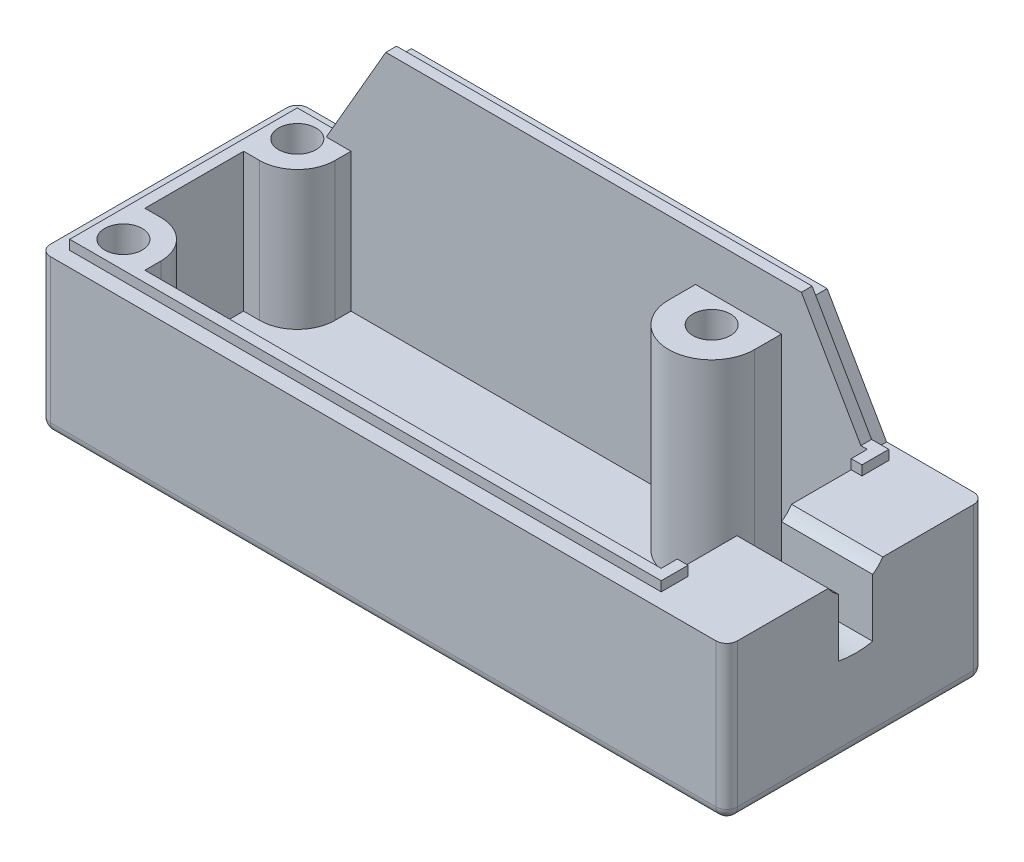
ISO-10303-21;
HEADER;
FILE_DESCRIPTION(('STEP AP214'),'2;1');
FILE_NAME('part.step','',(''),(''),'','','');
FILE_SCHEMA(('AUTOMOTIVE_DESIGN { 1 0 10303 214 1 1 1 1 }'));
ENDSEC;
DATA;
#1=APPLICATION_CONTEXT('core data for automotive mechanical design processes');
#2=APPLICATION_PROTOCOL_DEFINITION('international standard','automotive_design',2000,#1);
#3=PRODUCT_CONTEXT('',#1,'mechanical');
#4=PRODUCT('Part','Part','',(#3));
#5=PRODUCT_RELATED_PRODUCT_CATEGORY('part','',(#4));
#6=PRODUCT_DEFINITION_FORMATION('','',#4);
#7=PRODUCT_DEFINITION_CONTEXT('part definition',#1,'design');
#8=PRODUCT_DEFINITION('design','',#6,#7);
#9=PRODUCT_DEFINITION_SHAPE('','',#8);
#10=(LENGTH_UNIT() NAMED_UNIT(*) SI_UNIT(.MILLI.,.METRE.));
#11=(NAMED_UNIT(*) PLANE_ANGLE_UNIT() SI_UNIT($,.RADIAN.));
#12=(NAMED_UNIT(*) SI_UNIT($,.STERADIAN.) SOLID_ANGLE_UNIT());
#13=UNCERTAINTY_MEASURE_WITH_UNIT(LENGTH_MEASURE(1.E-05),#10,'distance_accuracy_value','');
#14=(GEOMETRIC_REPRESENTATION_CONTEXT(3) GLOBAL_UNCERTAINTY_ASSIGNED_CONTEXT((#13)) GLOBAL_UNIT_ASSIGNED_CONTEXT((#10,
#11,#12)) REPRESENTATION_CONTEXT('',''));
#15=CARTESIAN_POINT('',(0.,0.,0.));
#16=DIRECTION('',(0.,0.,1.));
#17=DIRECTION('',(1.,0.,0.));
#18=AXIS2_PLACEMENT_3D('',#15,#16,#17);
#19=CARTESIAN_POINT('',(0.,0.,0.));
#20=DIRECTION('',(0.,-1.,0.));
#21=DIRECTION('',(0.,0.,-1.));
#22=AXIS2_PLACEMENT_3D('',#19,#20,#21);
#23=PLANE('',#22);
#24=CARTESIAN_POINT('',(-20.5,0.,-7.1));
#25=DIRECTION('',(0.,-1.,0.));
#26=DIRECTION('',(0.,0.,-1.));
#27=AXIS2_PLACEMENT_3D('',#24,#25,#26);
#28=CIRCLE('',#27,3.);
#29=CARTESIAN_POINT('',(-20.5,0.,-10.1));
#30=VERTEX_POINT('',#29);
#31=EDGE_CURVE('E866',#30,#30,#28,.F.);
#32=ORIENTED_EDGE('',*,*,#31,.T.);
#33=EDGE_LOOP('',(#32));
#34=FACE_BOUND('',#33,.T.);
#35=CARTESIAN_POINT('',(-60.1,0.,8.10000000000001));
#36=DIRECTION('',(0.,-1.,0.));
#37=DIRECTION('',(0.,0.,-1.));
#38=AXIS2_PLACEMENT_3D('',#35,#36,#37);
#39=CIRCLE('',#38,3.);
#40=CARTESIAN_POINT('',(-63.,0.,7.33188542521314));
#41=VERTEX_POINT('',#40);
#42=CARTESIAN_POINT('',(-59.3318854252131,0.,11.));
#43=VERTEX_POINT('',#42);
#44=EDGE_CURVE('E396',#41,#43,#39,.T.);
#45=ORIENTED_EDGE('',*,*,#44,.F.);
#46=DIRECTION('',(0.,0.,1.));
#47=VECTOR('',#46,1.);
#48=CARTESIAN_POINT('',(-63.,0.,-12.));
#49=LINE('',#48,#47);
#50=CARTESIAN_POINT('',(-63.,0.,-7.33188542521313));
#51=VERTEX_POINT('',#50);
#52=EDGE_CURVE('E706',#41,#51,#49,.F.);
#53=ORIENTED_EDGE('',*,*,#52,.T.);
#54=CARTESIAN_POINT('',(-60.1,0.,-8.1));
#55=DIRECTION('',(0.,-1.,0.));
#56=DIRECTION('',(0.,0.,-1.));
#57=AXIS2_PLACEMENT_3D('',#54,#55,#56);
#58=CIRCLE('',#57,3.);
#59=CARTESIAN_POINT('',(-59.3318854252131,0.,-11.));
#60=VERTEX_POINT('',#59);
#61=EDGE_CURVE('E399',#60,#51,#58,.T.);
#62=ORIENTED_EDGE('',*,*,#61,.F.);
#63=DIRECTION('',(-1.,0.,0.));
#64=VECTOR('',#63,1.);
#65=CARTESIAN_POINT('',(0.,0.,-11.));
#66=LINE('',#65,#64);
#67=CARTESIAN_POINT('',(-1.,0.,-11.));
#68=VERTEX_POINT('',#67);
#69=EDGE_CURVE('E691',#60,#68,#66,.F.);
#70=ORIENTED_EDGE('',*,*,#69,.T.);
#71=DIRECTION('',(0.,0.,-1.));
#72=VECTOR('',#71,1.);
#73=CARTESIAN_POINT('',(-1.,0.,12.));
#74=LINE('',#73,#72);
#75=CARTESIAN_POINT('',(-1.,0.,11.));
#76=VERTEX_POINT('',#75);
#77=EDGE_CURVE('E693',#68,#76,#74,.F.);
#78=ORIENTED_EDGE('',*,*,#77,.T.);
#79=DIRECTION('',(1.,0.,0.));
#80=VECTOR('',#79,1.);
#81=CARTESIAN_POINT('',(-64.,0.,11.));
#82=LINE('',#81,#80);
#83=EDGE_CURVE('E695',#76,#43,#82,.F.);
#84=ORIENTED_EDGE('',*,*,#83,.T.);
#85=EDGE_LOOP('',(#45,#53,#62,#70,#78,#84));
#86=FACE_BOUND('',#85,.T.);
#87=ADVANCED_FACE('F39',(#34,#86),#23,.T.);
#88=DIRECTION('',(1.,0.,0.));
#89=VECTOR('',#88,1.);
#90=CARTESIAN_POINT('',(-64.,0.,11.));
#91=LINE('',#90,#89);
#92=CARTESIAN_POINT('',(-60.8681145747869,0.,11.));
#93=VERTEX_POINT('',#92);
#94=CARTESIAN_POINT('',(-63.,0.,11.));
#95=VERTEX_POINT('',#94);
#96=EDGE_CURVE('E701',#93,#95,#91,.F.);
#97=ORIENTED_EDGE('',*,*,#96,.T.);
#98=DIRECTION('',(0.,0.,1.));
#99=VECTOR('',#98,1.);
#100=CARTESIAN_POINT('',(-63.,0.,-12.));
#101=LINE('',#100,#99);
#102=CARTESIAN_POINT('',(-63.,0.,8.86811457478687));
#103=VERTEX_POINT('',#102);
#104=EDGE_CURVE('E703',#95,#103,#101,.F.);
#105=ORIENTED_EDGE('',*,*,#104,.T.);
#106=EDGE_CURVE('E395',#93,#103,#39,.T.);
#107=ORIENTED_EDGE('',*,*,#106,.F.);
#108=EDGE_LOOP('',(#97,#105,#107));
#109=FACE_BOUND('',#108,.T.);
#110=ADVANCED_FACE('F789',(#109),#23,.T.);
#111=CARTESIAN_POINT('',(-8.5,-56.4645906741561,-9.6));
#112=DIRECTION('',(0.,0.,-1.));
#113=DIRECTION('',(-1.,0.,0.));
#114=AXIS2_PLACEMENT_3D('',#111,#112,#113);
#115=PLANE('',#114);
#116=DIRECTION('',(0.,-1.,0.));
#117=VECTOR('',#116,1.);
#118=CARTESIAN_POINT('',(-16.5,20.6,-9.6));
#119=LINE('',#118,#117);
#120=CARTESIAN_POINT('',(-16.5,20.6,-9.6));
#121=VERTEX_POINT('',#120);
#122=CARTESIAN_POINT('',(-16.5,2.4,-9.6));
#123=VERTEX_POINT('',#122);
#124=EDGE_CURVE('E364',#121,#123,#119,.T.);
#125=ORIENTED_EDGE('',*,*,#124,.T.);
#126=DIRECTION('',(-1.,0.,0.));
#127=VECTOR('',#126,1.);
#128=CARTESIAN_POINT('',(-8.5,2.4,-9.6));
#129=LINE('',#128,#127);
#130=CARTESIAN_POINT('',(-8.5,2.4,-9.59999999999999));
#131=VERTEX_POINT('',#130);
#132=EDGE_CURVE('E642',#131,#123,#129,.T.);
#133=ORIENTED_EDGE('',*,*,#132,.F.);
#134=DIRECTION('',(0.,1.,0.));
#135=VECTOR('',#134,1.);
#136=CARTESIAN_POINT('',(-8.5,-56.4645906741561,-9.6));
#137=LINE('',#136,#135);
#138=CARTESIAN_POINT('',(-8.5,15.3,-9.6));
#139=VERTEX_POINT('',#138);
#140=EDGE_CURVE('E649',#131,#139,#137,.T.);
#141=ORIENTED_EDGE('',*,*,#140,.T.);
#142=DIRECTION('',(1.,0.,0.));
#143=VECTOR('',#142,1.);
#144=CARTESIAN_POINT('',(-9.1,15.3,-9.6));
#145=LINE('',#144,#143);
#146=CARTESIAN_POINT('',(-9.1,15.3,-9.6));
#147=VERTEX_POINT('',#146);
#148=EDGE_CURVE('E519',#147,#139,#145,.T.);
#149=ORIENTED_EDGE('',*,*,#148,.F.);
#150=DIRECTION('',(-0.499999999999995,0.866025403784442,0.));
#151=VECTOR('',#150,1.);
#152=CARTESIAN_POINT('',(-9.1,15.3,-9.6));
#153=LINE('',#152,#151);
#154=CARTESIAN_POINT('',(-14.6425625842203,24.9,-9.6));
#155=VERTEX_POINT('',#154);
#156=EDGE_CURVE('E445',#147,#155,#153,.T.);
#157=ORIENTED_EDGE('',*,*,#156,.T.);
#158=DIRECTION('',(-1.,0.,0.));
#159=VECTOR('',#158,1.);
#160=CARTESIAN_POINT('',(-14.6425625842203,24.9,-9.6));
#161=LINE('',#160,#159);
#162=CARTESIAN_POINT('',(-53.3574374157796,24.9,-9.6));
#163=VERTEX_POINT('',#162);
#164=EDGE_CURVE('E485',#155,#163,#161,.T.);
#165=ORIENTED_EDGE('',*,*,#164,.T.);
#166=DIRECTION('',(-0.500000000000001,-0.866025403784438,0.));
#167=VECTOR('',#166,1.);
#168=CARTESIAN_POINT('',(-53.3574374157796,24.9,-9.6));
#169=LINE('',#168,#167);
#170=CARTESIAN_POINT('',(-58.9,15.3,-9.6));
#171=VERTEX_POINT('',#170);
#172=EDGE_CURVE('E469',#163,#171,#169,.T.);
#173=ORIENTED_EDGE('',*,*,#172,.T.);
#174=DIRECTION('',(1.,0.,0.));
#175=VECTOR('',#174,1.);
#176=CARTESIAN_POINT('',(-61.6,15.3,-9.6));
#177=LINE('',#176,#175);
#178=CARTESIAN_POINT('',(-56.6,15.3,-9.6));
#179=VERTEX_POINT('',#178);
#180=EDGE_CURVE('E435',#171,#179,#177,.T.);
#181=ORIENTED_EDGE('',*,*,#180,.T.);
#182=DIRECTION('',(0.,-1.,0.));
#183=VECTOR('',#182,1.);
#184=CARTESIAN_POINT('',(-56.6,22.3710678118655,-9.6));
#185=LINE('',#184,#183);
#186=CARTESIAN_POINT('',(-56.6,2.4,-9.6));
#187=VERTEX_POINT('',#186);
#188=EDGE_CURVE('E458',#179,#187,#185,.T.);
#189=ORIENTED_EDGE('',*,*,#188,.T.);
#190=CARTESIAN_POINT('',(-24.5,2.4,-9.6));
#191=VERTEX_POINT('',#190);
#192=EDGE_CURVE('E645',#191,#187,#129,.T.);
#193=ORIENTED_EDGE('',*,*,#192,.F.);
#194=DIRECTION('',(0.,-1.,0.));
#195=VECTOR('',#194,1.);
#196=CARTESIAN_POINT('',(-24.5,20.6,-9.6));
#197=LINE('',#196,#195);
#198=CARTESIAN_POINT('',(-24.5,20.6,-9.6));
#199=VERTEX_POINT('',#198);
#200=EDGE_CURVE('E387',#199,#191,#197,.T.);
#201=ORIENTED_EDGE('',*,*,#200,.F.);
#202=DIRECTION('',(-1.,0.,0.));
#203=VECTOR('',#202,1.);
#204=CARTESIAN_POINT('',(-24.5,20.6,-9.6));
#205=LINE('',#204,#203);
#206=EDGE_CURVE('E367',#121,#199,#205,.T.);
#207=ORIENTED_EDGE('',*,*,#206,.F.);
#208=EDGE_LOOP('',(#125,#133,#141,#149,#157,#165,#173,#181,#189,#193,#201,#207));
#209=FACE_BOUND('',#208,.T.);
#210=ADVANCED_FACE('F796',(#209),#115,.F.);
#211=CARTESIAN_POINT('',(-60.1,20.2497474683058,-8.1));
#212=DIRECTION('',(0.,-1.,0.));
#213=DIRECTION('',(0.,0.,-1.));
#214=AXIS2_PLACEMENT_3D('',#211,#212,#213);
#215=CYLINDRICAL_SURFACE('',#214,1.75);
#216=CARTESIAN_POINT('',(-60.1,15.3,-8.1));
#217=DIRECTION('',(0.,-1.,0.));
#218=DIRECTION('',(0.,0.,-1.));
#219=AXIS2_PLACEMENT_3D('',#216,#217,#218);
#220=CIRCLE('',#219,1.75);
#221=CARTESIAN_POINT('',(-60.1,15.3,-9.85));
#222=VERTEX_POINT('',#221);
#223=EDGE_CURVE('E406',#222,#222,#220,.F.);
#224=ORIENTED_EDGE('',*,*,#223,.T.);
#225=EDGE_LOOP('',(#224));
#226=FACE_BOUND('',#225,.T.);
#227=CARTESIAN_POINT('',(-60.1,3.,-8.1));
#228=DIRECTION('',(0.,-1.,0.));
#229=DIRECTION('',(0.,0.,-1.));
#230=AXIS2_PLACEMENT_3D('',#227,#228,#229);
#231=CIRCLE('',#230,1.75);
#232=CARTESIAN_POINT('',(-60.1,3.,-9.85));
#233=VERTEX_POINT('',#232);
#234=EDGE_CURVE('E409',#233,#233,#231,.F.);
#235=ORIENTED_EDGE('',*,*,#234,.F.);
#236=EDGE_LOOP('',(#235));
#237=FACE_BOUND('',#236,.T.);
#238=ADVANCED_FACE('F1282',(#226,#237),#215,.F.);
#239=CARTESIAN_POINT('',(-60.1,20.2497474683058,8.10000000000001));
#240=DIRECTION('',(0.,-1.,0.));
#241=DIRECTION('',(0.,0.,-1.));
#242=AXIS2_PLACEMENT_3D('',#239,#240,#241);
#243=CYLINDRICAL_SURFACE('',#242,1.75);
#244=CARTESIAN_POINT('',(-60.1,15.3,8.10000000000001));
#245=DIRECTION('',(0.,-1.,0.));
#246=DIRECTION('',(0.,0.,-1.));
#247=AXIS2_PLACEMENT_3D('',#244,#245,#246);
#248=CIRCLE('',#247,1.75);
#249=CARTESIAN_POINT('',(-60.1,15.3,6.35));
#250=VERTEX_POINT('',#249);
#251=EDGE_CURVE('E402',#250,#250,#248,.F.);
#252=ORIENTED_EDGE('',*,*,#251,.T.);
#253=EDGE_LOOP('',(#252));
#254=FACE_BOUND('',#253,.T.);
#255=CARTESIAN_POINT('',(-60.1,3.,8.10000000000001));
#256=DIRECTION('',(0.,-1.,0.));
#257=DIRECTION('',(0.,0.,-1.));
#258=AXIS2_PLACEMENT_3D('',#255,#256,#257);
#259=CIRCLE('',#258,1.75);
#260=CARTESIAN_POINT('',(-60.1,3.,6.35));
#261=VERTEX_POINT('',#260);
#262=EDGE_CURVE('E394',#261,#261,#259,.F.);
#263=ORIENTED_EDGE('',*,*,#262,.F.);
#264=EDGE_LOOP('',(#263));
#265=FACE_BOUND('',#264,.T.);
#266=ADVANCED_FACE('F1280',(#254,#265),#243,.F.);
#267=CARTESIAN_POINT('',(-61.6,-56.4645906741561,9.59999999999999));
#268=DIRECTION('',(-1.,0.,0.));
#269=DIRECTION('',(0.,0.,1.));
#270=AXIS2_PLACEMENT_3D('',#267,#268,#269);
#271=PLANE('',#270);
#272=DIRECTION('',(0.,-1.,0.));
#273=VECTOR('',#272,1.);
#274=CARTESIAN_POINT('',(-61.6,22.3710678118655,4.59999999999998));
#275=LINE('',#274,#273);
#276=CARTESIAN_POINT('',(-61.6,15.3,4.59999999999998));
#277=VERTEX_POINT('',#276);
#278=CARTESIAN_POINT('',(-61.6,2.4,4.59999999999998));
#279=VERTEX_POINT('',#278);
#280=EDGE_CURVE('E415',#277,#279,#275,.T.);
#281=ORIENTED_EDGE('',*,*,#280,.T.);
#282=DIRECTION('',(0.,0.,1.));
#283=VECTOR('',#282,1.);
#284=CARTESIAN_POINT('',(-61.6,2.4,9.59999999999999));
#285=LINE('',#284,#283);
#286=CARTESIAN_POINT('',(-61.6,2.4,-4.6));
#287=VERTEX_POINT('',#286);
#288=EDGE_CURVE('E638',#287,#279,#285,.T.);
#289=ORIENTED_EDGE('',*,*,#288,.F.);
#290=DIRECTION('',(0.,-1.,0.));
#291=VECTOR('',#290,1.);
#292=CARTESIAN_POINT('',(-61.6,22.3710678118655,-4.6));
#293=LINE('',#292,#291);
#294=CARTESIAN_POINT('',(-61.6,15.3,-4.6));
#295=VERTEX_POINT('',#294);
#296=EDGE_CURVE('E456',#295,#287,#293,.T.);
#297=ORIENTED_EDGE('',*,*,#296,.F.);
#298=DIRECTION('',(0.,0.,-1.));
#299=VECTOR('',#298,1.);
#300=CARTESIAN_POINT('',(-61.6,15.3,-9.6));
#301=LINE('',#300,#299);
#302=EDGE_CURVE('E544',#277,#295,#301,.T.);
#303=ORIENTED_EDGE('',*,*,#302,.F.);
#304=EDGE_LOOP('',(#281,#289,#297,#303));
#305=FACE_BOUND('',#304,.T.);
#306=ADVANCED_FACE('F904',(#305),#271,.F.);
#307=CARTESIAN_POINT('',(-8.5,-56.4645906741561,9.59999999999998));
#308=DIRECTION('',(0.,0.,1.));
#309=DIRECTION('',(1.,0.,0.));
#310=AXIS2_PLACEMENT_3D('',#307,#308,#309);
#311=PLANE('',#310);
#312=DIRECTION('',(0.,-1.,0.));
#313=VECTOR('',#312,1.);
#314=CARTESIAN_POINT('',(-56.6,22.3710678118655,9.59999999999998));
#315=LINE('',#314,#313);
#316=CARTESIAN_POINT('',(-56.6,15.3,9.59999999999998));
#317=VERTEX_POINT('',#316);
#318=CARTESIAN_POINT('',(-56.6,2.4,9.59999999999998));
#319=VERTEX_POINT('',#318);
#320=EDGE_CURVE('E418',#317,#319,#315,.T.);
#321=ORIENTED_EDGE('',*,*,#320,.F.);
#322=DIRECTION('',(-1.,0.,0.));
#323=VECTOR('',#322,1.);
#324=CARTESIAN_POINT('',(-61.6,15.3,9.59999999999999));
#325=LINE('',#324,#323);
#326=CARTESIAN_POINT('',(-8.5,15.3,9.59999999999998));
#327=VERTEX_POINT('',#326);
#328=EDGE_CURVE('E541',#327,#317,#325,.T.);
#329=ORIENTED_EDGE('',*,*,#328,.F.);
#330=DIRECTION('',(0.,1.,0.));
#331=VECTOR('',#330,1.);
#332=CARTESIAN_POINT('',(-8.5,-56.4645906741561,9.59999999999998));
#333=LINE('',#332,#331);
#334=CARTESIAN_POINT('',(-8.5,2.4,9.59999999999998));
#335=VERTEX_POINT('',#334);
#336=EDGE_CURVE('E637',#335,#327,#333,.T.);
#337=ORIENTED_EDGE('',*,*,#336,.F.);
#338=DIRECTION('',(1.,0.,0.));
#339=VECTOR('',#338,1.);
#340=CARTESIAN_POINT('',(-8.5,2.4,9.59999999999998));
#341=LINE('',#340,#339);
#342=EDGE_CURVE('E635',#319,#335,#341,.T.);
#343=ORIENTED_EDGE('',*,*,#342,.F.);
#344=EDGE_LOOP('',(#321,#329,#337,#343));
#345=FACE_BOUND('',#344,.T.);
#346=ADVANCED_FACE('F923',(#345),#311,.F.);
#347=CARTESIAN_POINT('',(-58.9,14.4,41.11686110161));
#348=DIRECTION('',(-0.866025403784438,0.500000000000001,0.));
#349=DIRECTION('',(-0.500000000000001,-0.866025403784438,0.));
#350=AXIS2_PLACEMENT_3D('',#347,#348,#349);
#351=PLANE('',#350);
#352=DIRECTION('',(0.,0.,-1.));
#353=VECTOR('',#352,1.);
#354=CARTESIAN_POINT('',(-58.9,14.4,41.11686110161));
#355=LINE('',#354,#353);
#356=CARTESIAN_POINT('',(-58.9,14.4,-10.6));
#357=VERTEX_POINT('',#356);
#358=CARTESIAN_POINT('',(-58.9,14.4,-12.));
#359=VERTEX_POINT('',#358);
#360=EDGE_CURVE('E584',#357,#359,#355,.T.);
#361=ORIENTED_EDGE('',*,*,#360,.F.);
#362=DIRECTION('',(0.500000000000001,0.866025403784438,0.));
#363=VECTOR('',#362,1.);
#364=CARTESIAN_POINT('',(-58.9,14.4,-10.6));
#365=LINE('',#364,#363);
#366=CARTESIAN_POINT('',(-53.3574374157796,24.,-10.6));
#367=VERTEX_POINT('',#366);
#368=EDGE_CURVE('E465',#357,#367,#365,.T.);
#369=ORIENTED_EDGE('',*,*,#368,.T.);
#370=DIRECTION('',(0.,0.,-1.));
#371=VECTOR('',#370,1.);
#372=CARTESIAN_POINT('',(-53.3574374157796,24.,41.11686110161));
#373=LINE('',#372,#371);
#374=CARTESIAN_POINT('',(-53.3574374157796,24.,-12.));
#375=VERTEX_POINT('',#374);
#376=EDGE_CURVE('E583',#367,#375,#373,.T.);
#377=ORIENTED_EDGE('',*,*,#376,.T.);
#378=DIRECTION('',(0.500000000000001,0.866025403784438,0.));
#379=VECTOR('',#378,1.);
#380=CARTESIAN_POINT('',(-58.9,14.4,-12.));
#381=LINE('',#380,#379);
#382=EDGE_CURVE('E574',#359,#375,#381,.T.);
#383=ORIENTED_EDGE('',*,*,#382,.F.);
#384=EDGE_LOOP('',(#361,#369,#377,#383));
#385=FACE_BOUND('',#384,.T.);
#386=ADVANCED_FACE('F1270',(#385),#351,.T.);
#387=CARTESIAN_POINT('',(-14.6425625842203,24.,41.11686110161));
#388=DIRECTION('',(0.866025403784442,0.499999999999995,0.));
#389=DIRECTION('',(-0.499999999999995,0.866025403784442,0.));
#390=AXIS2_PLACEMENT_3D('',#387,#388,#389);
#391=PLANE('',#390);
#392=DIRECTION('',(0.,0.,-1.));
#393=VECTOR('',#392,1.);
#394=CARTESIAN_POINT('',(-14.6425625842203,24.,41.11686110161));
#395=LINE('',#394,#393);
#396=CARTESIAN_POINT('',(-14.6425625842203,24.,-10.6));
#397=VERTEX_POINT('',#396);
#398=CARTESIAN_POINT('',(-14.6425625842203,24.,-12.));
#399=VERTEX_POINT('',#398);
#400=EDGE_CURVE('E590',#397,#399,#395,.T.);
#401=ORIENTED_EDGE('',*,*,#400,.F.);
#402=DIRECTION('',(0.499999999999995,-0.866025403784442,0.));
#403=VECTOR('',#402,1.);
#404=CARTESIAN_POINT('',(-14.6425625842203,24.,-10.6));
#405=LINE('',#404,#403);
#406=CARTESIAN_POINT('',(-9.1,14.4,-10.6));
#407=VERTEX_POINT('',#406);
#408=EDGE_CURVE('E472',#397,#407,#405,.T.);
#409=ORIENTED_EDGE('',*,*,#408,.T.);
#410=DIRECTION('',(0.,0.,-1.));
#411=VECTOR('',#410,1.);
#412=CARTESIAN_POINT('',(-9.1,14.4,41.11686110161));
#413=LINE('',#412,#411);
#414=CARTESIAN_POINT('',(-9.1,14.4,-12.));
#415=VERTEX_POINT('',#414);
#416=EDGE_CURVE('E587',#407,#415,#413,.T.);
#417=ORIENTED_EDGE('',*,*,#416,.T.);
#418=DIRECTION('',(0.499999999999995,-0.866025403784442,0.));
#419=VECTOR('',#418,1.);
#420=CARTESIAN_POINT('',(-14.6425625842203,24.,-12.));
#421=LINE('',#420,#419);
#422=EDGE_CURVE('E580',#399,#415,#421,.T.);
#423=ORIENTED_EDGE('',*,*,#422,.F.);
#424=EDGE_LOOP('',(#401,#409,#417,#423));
#425=FACE_BOUND('',#424,.T.);
#426=ADVANCED_FACE('F1289',(#425),#391,.T.);
#427=CARTESIAN_POINT('',(-53.3574374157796,24.,41.11686110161));
#428=DIRECTION('',(0.,1.,0.));
#429=DIRECTION('',(-1.,0.,0.));
#430=AXIS2_PLACEMENT_3D('',#427,#428,#429);
#431=PLANE('',#430);
#432=ORIENTED_EDGE('',*,*,#376,.F.);
#433=DIRECTION('',(1.,0.,0.));
#434=VECTOR('',#433,1.);
#435=CARTESIAN_POINT('',(-53.3574374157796,24.,-10.6));
#436=LINE('',#435,#434);
#437=EDGE_CURVE('E468',#367,#397,#436,.T.);
#438=ORIENTED_EDGE('',*,*,#437,.T.);
#439=ORIENTED_EDGE('',*,*,#400,.T.);
#440=DIRECTION('',(1.,0.,0.));
#441=VECTOR('',#440,1.);
#442=CARTESIAN_POINT('',(-53.3574374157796,24.,-12.));
#443=LINE('',#442,#441);
#444=EDGE_CURVE('E577',#375,#399,#443,.T.);
#445=ORIENTED_EDGE('',*,*,#444,.F.);
#446=EDGE_LOOP('',(#432,#438,#439,#445));
#447=FACE_BOUND('',#446,.T.);
#448=ADVANCED_FACE('F1055',(#447),#431,.T.);
#449=CARTESIAN_POINT('',(0.,14.4,0.));
#450=DIRECTION('',(0.,-1.,0.));
#451=DIRECTION('',(0.,0.,-1.));
#452=AXIS2_PLACEMENT_3D('',#449,#450,#451);
#453=PLANE('',#452);
#454=DIRECTION('',(0.,0.,-1.));
#455=VECTOR('',#454,1.);
#456=CARTESIAN_POINT('',(0.,14.4,12.));
#457=LINE('',#456,#455);
#458=CARTESIAN_POINT('',(0.,14.4,-2.53771550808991));
#459=VERTEX_POINT('',#458);
#460=CARTESIAN_POINT('',(0.,14.4,-11.));
#461=VERTEX_POINT('',#460);
#462=EDGE_CURVE('E641',#459,#461,#457,.T.);
#463=ORIENTED_EDGE('',*,*,#462,.T.);
#464=CARTESIAN_POINT('',(-1.,14.4,-11.));
#465=DIRECTION('',(0.,-1.,0.));
#466=DIRECTION('',(0.,0.,-1.));
#467=AXIS2_PLACEMENT_3D('',#464,#465,#466);
#468=CIRCLE('',#467,1.);
#469=CARTESIAN_POINT('',(-1.,14.4,-12.));
#470=VERTEX_POINT('',#469);
#471=EDGE_CURVE('E12',#461,#470,#468,.F.);
#472=ORIENTED_EDGE('',*,*,#471,.T.);
#473=DIRECTION('',(-1.,0.,0.));
#474=VECTOR('',#473,1.);
#475=CARTESIAN_POINT('',(-64.,14.4,-12.));
#476=LINE('',#475,#474);
#477=EDGE_CURVE('E655',#470,#415,#476,.T.);
#478=ORIENTED_EDGE('',*,*,#477,.T.);
#479=ORIENTED_EDGE('',*,*,#416,.F.);
#480=DIRECTION('',(-1.,0.,0.));
#481=VECTOR('',#480,1.);
#482=CARTESIAN_POINT('',(-9.1,14.4,-10.6));
#483=LINE('',#482,#481);
#484=CARTESIAN_POINT('',(-7.5,14.4,-10.6));
#485=VERTEX_POINT('',#484);
#486=EDGE_CURVE('E502',#485,#407,#483,.T.);
#487=ORIENTED_EDGE('',*,*,#486,.F.);
#488=DIRECTION('',(0.,0.,-1.));
#489=VECTOR('',#488,1.);
#490=CARTESIAN_POINT('',(-7.5,14.4,-10.6));
#491=LINE('',#490,#489);
#492=CARTESIAN_POINT('',(-7.5,14.4,-8.1));
#493=VERTEX_POINT('',#492);
#494=EDGE_CURVE('E505',#493,#485,#491,.T.);
#495=ORIENTED_EDGE('',*,*,#494,.F.);
#496=DIRECTION('',(1.,0.,0.));
#497=VECTOR('',#496,1.);
#498=CARTESIAN_POINT('',(-7.5,14.4,-8.1));
#499=LINE('',#498,#497);
#500=CARTESIAN_POINT('',(-8.5,14.4,-8.1));
#501=VERTEX_POINT('',#500);
#502=EDGE_CURVE('E508',#501,#493,#499,.T.);
#503=ORIENTED_EDGE('',*,*,#502,.F.);
#504=DIRECTION('',(0.,0.,-1.));
#505=VECTOR('',#504,1.);
#506=CARTESIAN_POINT('',(-8.5,14.4,9.59999999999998));
#507=LINE('',#506,#505);
#508=CARTESIAN_POINT('',(-8.5,14.4,-2.53771550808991));
#509=VERTEX_POINT('',#508);
#510=EDGE_CURVE('E632',#509,#501,#507,.T.);
#511=ORIENTED_EDGE('',*,*,#510,.F.);
#512=DIRECTION('',(1.,0.,0.));
#513=VECTOR('',#512,1.);
#514=CARTESIAN_POINT('',(-16.7468175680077,14.4,-2.53771550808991));
#515=LINE('',#514,#513);
#516=EDGE_CURVE('E625',#509,#459,#515,.T.);
#517=ORIENTED_EDGE('',*,*,#516,.T.);
#518=EDGE_LOOP('',(#463,#472,#478,#479,#487,#495,#503,#511,#517));
#519=FACE_BOUND('',#518,.T.);
#520=ADVANCED_FACE('F1050',(#519),#453,.F.);
#521=CARTESIAN_POINT('',(-63.,14.4,-12.));
#522=VERTEX_POINT('',#521);
#523=EDGE_CURVE('E654',#359,#522,#476,.T.);
#524=ORIENTED_EDGE('',*,*,#523,.T.);
#525=CARTESIAN_POINT('',(-63.,14.4,-11.));
#526=DIRECTION('',(0.,-1.,0.));
#527=DIRECTION('',(0.,0.,-1.));
#528=AXIS2_PLACEMENT_3D('',#525,#526,#527);
#529=CIRCLE('',#528,1.);
#530=CARTESIAN_POINT('',(-64.,14.4,-11.));
#531=VERTEX_POINT('',#530);
#532=EDGE_CURVE('E689',#522,#531,#529,.F.);
#533=ORIENTED_EDGE('',*,*,#532,.T.);
#534=DIRECTION('',(0.,0.,1.));
#535=VECTOR('',#534,1.);
#536=CARTESIAN_POINT('',(-64.,14.4,12.));
#537=LINE('',#536,#535);
#538=CARTESIAN_POINT('',(-64.,14.4,11.));
#539=VERTEX_POINT('',#538);
#540=EDGE_CURVE('E657',#531,#539,#537,.T.);
#541=ORIENTED_EDGE('',*,*,#540,.T.);
#542=CARTESIAN_POINT('',(-63.,14.4,11.));
#543=DIRECTION('',(0.,-1.,0.));
#544=DIRECTION('',(0.,0.,-1.));
#545=AXIS2_PLACEMENT_3D('',#542,#543,#544);
#546=CIRCLE('',#545,1.);
#547=CARTESIAN_POINT('',(-63.,14.4,12.));
#548=VERTEX_POINT('',#547);
#549=EDGE_CURVE('E687',#539,#548,#546,.F.);
#550=ORIENTED_EDGE('',*,*,#549,.T.);
#551=DIRECTION('',(1.,0.,0.));
#552=VECTOR('',#551,1.);
#553=CARTESIAN_POINT('',(-64.,14.4,12.));
#554=LINE('',#553,#552);
#555=CARTESIAN_POINT('',(-1.,14.4,12.));
#556=VERTEX_POINT('',#555);
#557=EDGE_CURVE('E660',#548,#556,#554,.T.);
#558=ORIENTED_EDGE('',*,*,#557,.T.);
#559=CARTESIAN_POINT('',(-1.,14.4,11.));
#560=DIRECTION('',(0.,-1.,0.));
#561=DIRECTION('',(0.,0.,-1.));
#562=AXIS2_PLACEMENT_3D('',#559,#560,#561);
#563=CIRCLE('',#562,1.);
#564=CARTESIAN_POINT('',(0.,14.4,11.));
#565=VERTEX_POINT('',#564);
#566=EDGE_CURVE('E685',#556,#565,#563,.F.);
#567=ORIENTED_EDGE('',*,*,#566,.T.);
#568=CARTESIAN_POINT('',(0.,14.4,2.53771550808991));
#569=VERTEX_POINT('',#568);
#570=EDGE_CURVE('E652',#565,#569,#457,.T.);
#571=ORIENTED_EDGE('',*,*,#570,.T.);
#572=DIRECTION('',(1.,0.,0.));
#573=VECTOR('',#572,1.);
#574=CARTESIAN_POINT('',(-16.7468175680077,14.4,2.53771550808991));
#575=LINE('',#574,#573);
#576=CARTESIAN_POINT('',(-8.5,14.4,2.53771550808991));
#577=VERTEX_POINT('',#576);
#578=EDGE_CURVE('E622',#577,#569,#575,.T.);
#579=ORIENTED_EDGE('',*,*,#578,.F.);
#580=CARTESIAN_POINT('',(-8.5,14.4,8.09999999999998));
#581=VERTEX_POINT('',#580);
#582=EDGE_CURVE('E633',#581,#577,#507,.T.);
#583=ORIENTED_EDGE('',*,*,#582,.F.);
#584=DIRECTION('',(-1.,0.,0.));
#585=VECTOR('',#584,1.);
#586=CARTESIAN_POINT('',(-7.5,14.4,8.09999999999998));
#587=LINE('',#586,#585);
#588=CARTESIAN_POINT('',(-7.5,14.4,8.09999999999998));
#589=VERTEX_POINT('',#588);
#590=EDGE_CURVE('E528',#589,#581,#587,.T.);
#591=ORIENTED_EDGE('',*,*,#590,.F.);
#592=DIRECTION('',(0.,0.,-1.));
#593=VECTOR('',#592,1.);
#594=CARTESIAN_POINT('',(-7.5,14.4,10.6));
#595=LINE('',#594,#593);
#596=CARTESIAN_POINT('',(-7.5,14.4,10.6));
#597=VERTEX_POINT('',#596);
#598=EDGE_CURVE('E555',#597,#589,#595,.T.);
#599=ORIENTED_EDGE('',*,*,#598,.F.);
#600=DIRECTION('',(1.,0.,0.));
#601=VECTOR('',#600,1.);
#602=CARTESIAN_POINT('',(-62.6,14.4,10.6));
#603=LINE('',#602,#601);
#604=CARTESIAN_POINT('',(-62.6,14.4,10.6));
#605=VERTEX_POINT('',#604);
#606=EDGE_CURVE('E552',#605,#597,#603,.T.);
#607=ORIENTED_EDGE('',*,*,#606,.F.);
#608=DIRECTION('',(0.,0.,1.));
#609=VECTOR('',#608,1.);
#610=CARTESIAN_POINT('',(-62.6,14.4,-10.6));
#611=LINE('',#610,#609);
#612=CARTESIAN_POINT('',(-62.6,14.4,-10.6));
#613=VERTEX_POINT('',#612);
#614=EDGE_CURVE('E549',#613,#605,#611,.T.);
#615=ORIENTED_EDGE('',*,*,#614,.F.);
#616=DIRECTION('',(-1.,0.,0.));
#617=VECTOR('',#616,1.);
#618=CARTESIAN_POINT('',(-58.9,14.4,-10.6));
#619=LINE('',#618,#617);
#620=EDGE_CURVE('E510',#357,#613,#619,.T.);
#621=ORIENTED_EDGE('',*,*,#620,.F.);
#622=ORIENTED_EDGE('',*,*,#360,.T.);
#623=EDGE_LOOP('',(#524,#533,#541,#550,#558,#567,#571,#579,#583,#591,#599,#607,#615,#621,#622));
#624=FACE_BOUND('',#623,.T.);
#625=ADVANCED_FACE('F943',(#624),#453,.F.);
#626=CARTESIAN_POINT('',(0.,14.4,12.));
#627=DIRECTION('',(-1.,0.,0.));
#628=DIRECTION('',(0.,0.,1.));
#629=AXIS2_PLACEMENT_3D('',#626,#627,#628);
#630=PLANE('',#629);
#631=ORIENTED_EDGE('',*,*,#570,.F.);
#632=DIRECTION('',(0.,-1.,0.));
#633=VECTOR('',#632,1.);
#634=CARTESIAN_POINT('',(0.,14.4,11.));
#635=LINE('',#634,#633);
#636=CARTESIAN_POINT('',(0.,0.999999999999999,11.));
#637=VERTEX_POINT('',#636);
#638=EDGE_CURVE('E48',#565,#637,#635,.T.);
#639=ORIENTED_EDGE('',*,*,#638,.T.);
#640=DIRECTION('',(0.,0.,-1.));
#641=VECTOR('',#640,1.);
#642=CARTESIAN_POINT('',(0.,0.999999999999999,-12.));
#643=LINE('',#642,#641);
#644=CARTESIAN_POINT('',(0.,0.999999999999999,-11.));
#645=VERTEX_POINT('',#644);
#646=EDGE_CURVE('E60',#637,#645,#643,.T.);
#647=ORIENTED_EDGE('',*,*,#646,.T.);
#648=DIRECTION('',(0.,-1.,0.));
#649=VECTOR('',#648,1.);
#650=CARTESIAN_POINT('',(0.,14.4,-11.));
#651=LINE('',#650,#649);
#652=EDGE_CURVE('E950',#645,#461,#651,.F.);
#653=ORIENTED_EDGE('',*,*,#652,.T.);
#654=ORIENTED_EDGE('',*,*,#462,.F.);
#655=CARTESIAN_POINT('',(0.,16.,0.));
#656=DIRECTION('',(1.,0.,0.));
#657=DIRECTION('',(0.,0.,-1.));
#658=AXIS2_PLACEMENT_3D('',#655,#656,#657);
#659=CIRCLE('',#658,3.);
#660=CARTESIAN_POINT('',(0.,13.4622844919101,-1.6));
#661=VERTEX_POINT('',#660);
#662=EDGE_CURVE('E610',#661,#459,#659,.T.);
#663=ORIENTED_EDGE('',*,*,#662,.F.);
#664=DIRECTION('',(0.,1.,0.));
#665=VECTOR('',#664,1.);
#666=CARTESIAN_POINT('',(0.,8.05959698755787,-1.6));
#667=LINE('',#666,#665);
#668=CARTESIAN_POINT('',(0.,8.05959698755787,-1.6));
#669=VERTEX_POINT('',#668);
#670=EDGE_CURVE('E607',#669,#661,#667,.T.);
#671=ORIENTED_EDGE('',*,*,#670,.F.);
#672=CARTESIAN_POINT('',(0.,16.,0.));
#673=DIRECTION('',(1.,0.,0.));
#674=DIRECTION('',(0.,0.,-1.));
#675=AXIS2_PLACEMENT_3D('',#672,#673,#674);
#676=CIRCLE('',#675,8.1);
#677=CARTESIAN_POINT('',(0.,8.05959698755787,1.6));
#678=VERTEX_POINT('',#677);
#679=EDGE_CURVE('E586',#678,#669,#676,.T.);
#680=ORIENTED_EDGE('',*,*,#679,.F.);
#681=DIRECTION('',(0.,-1.,0.));
#682=VECTOR('',#681,1.);
#683=CARTESIAN_POINT('',(0.,13.4622844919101,1.6));
#684=LINE('',#683,#682);
#685=CARTESIAN_POINT('',(0.,13.4622844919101,1.6));
#686=VERTEX_POINT('',#685);
#687=EDGE_CURVE('E615',#686,#678,#684,.T.);
#688=ORIENTED_EDGE('',*,*,#687,.F.);
#689=CARTESIAN_POINT('',(0.,16.,0.));
#690=DIRECTION('',(1.,0.,0.));
#691=DIRECTION('',(0.,0.,-1.));
#692=AXIS2_PLACEMENT_3D('',#689,#690,#691);
#693=CIRCLE('',#692,3.);
#694=EDGE_CURVE('E612',#569,#686,#693,.T.);
#695=ORIENTED_EDGE('',*,*,#694,.F.);
#696=EDGE_LOOP('',(#631,#639,#647,#653,#654,#663,#671,#680,#688,#695));
#697=FACE_BOUND('',#696,.T.);
#698=ADVANCED_FACE('F945',(#697),#630,.F.);
#699=CARTESIAN_POINT('',(-64.,14.4,-12.));
#700=DIRECTION('',(0.,0.,1.));
#701=DIRECTION('',(1.,0.,0.));
#702=AXIS2_PLACEMENT_3D('',#699,#700,#701);
#703=PLANE('',#702);
#704=DIRECTION('',(-1.,0.,0.));
#705=VECTOR('',#704,1.);
#706=CARTESIAN_POINT('',(-64.,0.999999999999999,-12.));
#707=LINE('',#706,#705);
#708=CARTESIAN_POINT('',(-1.,0.999999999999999,-12.));
#709=VERTEX_POINT('',#708);
#710=CARTESIAN_POINT('',(-63.,0.999999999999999,-12.));
#711=VERTEX_POINT('',#710);
#712=EDGE_CURVE('E681',#709,#711,#707,.T.);
#713=ORIENTED_EDGE('',*,*,#712,.T.);
#714=DIRECTION('',(0.,-1.,0.));
#715=VECTOR('',#714,1.);
#716=CARTESIAN_POINT('',(-63.,14.4,-12.));
#717=LINE('',#716,#715);
#718=EDGE_CURVE('E683',#711,#522,#717,.F.);
#719=ORIENTED_EDGE('',*,*,#718,.T.);
#720=ORIENTED_EDGE('',*,*,#523,.F.);
#721=ORIENTED_EDGE('',*,*,#382,.T.);
#722=ORIENTED_EDGE('',*,*,#444,.T.);
#723=ORIENTED_EDGE('',*,*,#422,.T.);
#724=ORIENTED_EDGE('',*,*,#477,.F.);
#725=DIRECTION('',(0.,-1.,0.));
#726=VECTOR('',#725,1.);
#727=CARTESIAN_POINT('',(-1.,14.4,-12.));
#728=LINE('',#727,#726);
#729=EDGE_CURVE('E679',#470,#709,#728,.T.);
#730=ORIENTED_EDGE('',*,*,#729,.T.);
#731=EDGE_LOOP('',(#713,#719,#720,#721,#722,#723,#724,#730));
#732=FACE_BOUND('',#731,.T.);
#733=ADVANCED_FACE('F1074',(#732),#703,.F.);
#734=CARTESIAN_POINT('',(-64.,14.4,12.));
#735=DIRECTION('',(1.,0.,0.));
#736=DIRECTION('',(0.,0.,-1.));
#737=AXIS2_PLACEMENT_3D('',#734,#735,#736);
#738=PLANE('',#737);
#739=ORIENTED_EDGE('',*,*,#540,.F.);
#740=DIRECTION('',(0.,-1.,0.));
#741=VECTOR('',#740,1.);
#742=CARTESIAN_POINT('',(-64.,14.4,-11.));
#743=LINE('',#742,#741);
#744=CARTESIAN_POINT('',(-64.,0.999999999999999,-11.));
#745=VERTEX_POINT('',#744);
#746=EDGE_CURVE('E676',#531,#745,#743,.T.);
#747=ORIENTED_EDGE('',*,*,#746,.T.);
#748=DIRECTION('',(0.,0.,1.));
#749=VECTOR('',#748,1.);
#750=CARTESIAN_POINT('',(-64.,0.999999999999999,12.));
#751=LINE('',#750,#749);
#752=CARTESIAN_POINT('',(-64.,0.999999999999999,11.));
#753=VERTEX_POINT('',#752);
#754=EDGE_CURVE('E674',#745,#753,#751,.T.);
#755=ORIENTED_EDGE('',*,*,#754,.T.);
#756=DIRECTION('',(0.,-1.,0.));
#757=VECTOR('',#756,1.);
#758=CARTESIAN_POINT('',(-64.,14.4,11.));
#759=LINE('',#758,#757);
#760=EDGE_CURVE('E663',#753,#539,#759,.F.);
#761=ORIENTED_EDGE('',*,*,#760,.T.);
#762=EDGE_LOOP('',(#739,#747,#755,#761));
#763=FACE_BOUND('',#762,.T.);
#764=ADVANCED_FACE('F813',(#763),#738,.F.);
#765=CARTESIAN_POINT('',(-64.,14.4,12.));
#766=DIRECTION('',(0.,0.,-1.));
#767=DIRECTION('',(-1.,0.,0.));
#768=AXIS2_PLACEMENT_3D('',#765,#766,#767);
#769=PLANE('',#768);
#770=ORIENTED_EDGE('',*,*,#557,.F.);
#771=DIRECTION('',(0.,-1.,0.));
#772=VECTOR('',#771,1.);
#773=CARTESIAN_POINT('',(-63.,14.4,12.));
#774=LINE('',#773,#772);
#775=CARTESIAN_POINT('',(-63.,0.999999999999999,12.));
#776=VERTEX_POINT('',#775);
#777=EDGE_CURVE('E954',#548,#776,#774,.T.);
#778=ORIENTED_EDGE('',*,*,#777,.T.);
#779=DIRECTION('',(1.,0.,0.));
#780=VECTOR('',#779,1.);
#781=CARTESIAN_POINT('',(0.,0.999999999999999,12.));
#782=LINE('',#781,#780);
#783=CARTESIAN_POINT('',(-1.,0.999999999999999,12.));
#784=VERTEX_POINT('',#783);
#785=EDGE_CURVE('E955',#776,#784,#782,.T.);
#786=ORIENTED_EDGE('',*,*,#785,.T.);
#787=DIRECTION('',(0.,-1.,0.));
#788=VECTOR('',#787,1.);
#789=CARTESIAN_POINT('',(-1.,14.4,12.));
#790=LINE('',#789,#788);
#791=EDGE_CURVE('E757',#784,#556,#790,.F.);
#792=ORIENTED_EDGE('',*,*,#791,.T.);
#793=EDGE_LOOP('',(#770,#778,#786,#792));
#794=FACE_BOUND('',#793,.T.);
#795=ADVANCED_FACE('F804',(#794),#769,.F.);
#796=CARTESIAN_POINT('',(-63.,0.,-8.86811457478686));
#797=VERTEX_POINT('',#796);
#798=CARTESIAN_POINT('',(-60.8681145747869,0.,-11.));
#799=VERTEX_POINT('',#798);
#800=EDGE_CURVE('E385',#797,#799,#58,.T.);
#801=ORIENTED_EDGE('',*,*,#800,.F.);
#802=DIRECTION('',(0.,0.,1.));
#803=VECTOR('',#802,1.);
#804=CARTESIAN_POINT('',(-63.,0.,-12.));
#805=LINE('',#804,#803);
#806=CARTESIAN_POINT('',(-63.,0.,-11.));
#807=VERTEX_POINT('',#806);
#808=EDGE_CURVE('E699',#797,#807,#805,.F.);
#809=ORIENTED_EDGE('',*,*,#808,.T.);
#810=DIRECTION('',(-1.,0.,0.));
#811=VECTOR('',#810,1.);
#812=CARTESIAN_POINT('',(0.,0.,-11.));
#813=LINE('',#812,#811);
#814=EDGE_CURVE('E697',#807,#799,#813,.F.);
#815=ORIENTED_EDGE('',*,*,#814,.T.);
#816=EDGE_LOOP('',(#801,#809,#815));
#817=FACE_BOUND('',#816,.T.);
#818=ADVANCED_FACE('F792',(#817),#23,.T.);
#819=CARTESIAN_POINT('',(0.,2.4,0.));
#820=DIRECTION('',(0.,-1.,0.));
#821=DIRECTION('',(0.,0.,-1.));
#822=AXIS2_PLACEMENT_3D('',#819,#820,#821);
#823=PLANE('',#822);
#824=DIRECTION('',(0.,0.,-1.));
#825=VECTOR('',#824,1.);
#826=CARTESIAN_POINT('',(-16.5,2.4,-9.6));
#827=LINE('',#826,#825);
#828=CARTESIAN_POINT('',(-16.5,2.4,-7.1));
#829=VERTEX_POINT('',#828);
#830=EDGE_CURVE('E880',#829,#123,#827,.T.);
#831=ORIENTED_EDGE('',*,*,#830,.F.);
#832=CARTESIAN_POINT('',(-20.5,2.4,-7.1));
#833=DIRECTION('',(0.,1.,0.));
#834=DIRECTION('',(0.,0.,1.));
#835=AXIS2_PLACEMENT_3D('',#832,#833,#834);
#836=CIRCLE('',#835,4.);
#837=CARTESIAN_POINT('',(-24.5,2.4,-7.1));
#838=VERTEX_POINT('',#837);
#839=EDGE_CURVE('E381',#838,#829,#836,.T.);
#840=ORIENTED_EDGE('',*,*,#839,.F.);
#841=DIRECTION('',(0.,0.,1.));
#842=VECTOR('',#841,1.);
#843=CARTESIAN_POINT('',(-24.5,2.4,-7.1));
#844=LINE('',#843,#842);
#845=EDGE_CURVE('E378',#191,#838,#844,.T.);
#846=ORIENTED_EDGE('',*,*,#845,.F.);
#847=ORIENTED_EDGE('',*,*,#192,.T.);
#848=DIRECTION('',(0.,0.,-1.));
#849=VECTOR('',#848,1.);
#850=CARTESIAN_POINT('',(-56.6,2.4,-8.1));
#851=LINE('',#850,#849);
#852=CARTESIAN_POINT('',(-56.6,2.4,-8.1));
#853=VERTEX_POINT('',#852);
#854=EDGE_CURVE('E448',#853,#187,#851,.T.);
#855=ORIENTED_EDGE('',*,*,#854,.F.);
#856=CARTESIAN_POINT('',(-60.1,2.4,-8.1));
#857=DIRECTION('',(0.,1.,0.));
#858=DIRECTION('',(0.,0.,1.));
#859=AXIS2_PLACEMENT_3D('',#856,#857,#858);
#860=CIRCLE('',#859,3.5);
#861=CARTESIAN_POINT('',(-60.1,2.4,-4.6));
#862=VERTEX_POINT('',#861);
#863=EDGE_CURVE('E430',#862,#853,#860,.T.);
#864=ORIENTED_EDGE('',*,*,#863,.F.);
#865=DIRECTION('',(1.,0.,0.));
#866=VECTOR('',#865,1.);
#867=CARTESIAN_POINT('',(-60.1,2.4,-4.6));
#868=LINE('',#867,#866);
#869=EDGE_CURVE('E451',#287,#862,#868,.T.);
#870=ORIENTED_EDGE('',*,*,#869,.F.);
#871=ORIENTED_EDGE('',*,*,#288,.T.);
#872=DIRECTION('',(-1.,0.,0.));
#873=VECTOR('',#872,1.);
#874=CARTESIAN_POINT('',(-60.1,2.4,4.59999999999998));
#875=LINE('',#874,#873);
#876=CARTESIAN_POINT('',(-60.1,2.4,4.59999999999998));
#877=VERTEX_POINT('',#876);
#878=EDGE_CURVE('E425',#877,#279,#875,.T.);
#879=ORIENTED_EDGE('',*,*,#878,.F.);
#880=CARTESIAN_POINT('',(-60.1,2.4,8.09999999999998));
#881=DIRECTION('',(0.,1.,0.));
#882=DIRECTION('',(0.,0.,1.));
#883=AXIS2_PLACEMENT_3D('',#880,#881,#882);
#884=CIRCLE('',#883,3.5);
#885=CARTESIAN_POINT('',(-56.6,2.4,8.09999999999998));
#886=VERTEX_POINT('',#885);
#887=EDGE_CURVE('E427',#886,#877,#884,.T.);
#888=ORIENTED_EDGE('',*,*,#887,.F.);
#889=DIRECTION('',(0.,0.,-1.));
#890=VECTOR('',#889,1.);
#891=CARTESIAN_POINT('',(-56.6,2.4,9.59999999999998));
#892=LINE('',#891,#890);
#893=EDGE_CURVE('E422',#319,#886,#892,.T.);
#894=ORIENTED_EDGE('',*,*,#893,.F.);
#895=ORIENTED_EDGE('',*,*,#342,.T.);
#896=DIRECTION('',(0.,0.,-1.));
#897=VECTOR('',#896,1.);
#898=CARTESIAN_POINT('',(-8.5,2.4,9.59999999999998));
#899=LINE('',#898,#897);
#900=EDGE_CURVE('E646',#335,#131,#899,.T.);
#901=ORIENTED_EDGE('',*,*,#900,.T.);
#902=ORIENTED_EDGE('',*,*,#132,.T.);
#903=EDGE_LOOP('',(#831,#840,#846,#847,#855,#864,#870,#871,#879,#888,#894,#895,#901,#902));
#904=FACE_BOUND('',#903,.T.);
#905=ADVANCED_FACE('F803',(#904),#823,.F.);
#906=CARTESIAN_POINT('',(-8.5,-56.4645906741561,9.59999999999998));
#907=DIRECTION('',(1.,0.,0.));
#908=DIRECTION('',(0.,0.,-1.));
#909=AXIS2_PLACEMENT_3D('',#906,#907,#908);
#910=PLANE('',#909);
#911=ORIENTED_EDGE('',*,*,#336,.T.);
#912=DIRECTION('',(0.,0.,1.));
#913=VECTOR('',#912,1.);
#914=CARTESIAN_POINT('',(-8.5,15.3,9.59999999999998));
#915=LINE('',#914,#913);
#916=CARTESIAN_POINT('',(-8.5,15.3,8.09999999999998));
#917=VERTEX_POINT('',#916);
#918=EDGE_CURVE('E538',#917,#327,#915,.T.);
#919=ORIENTED_EDGE('',*,*,#918,.F.);
#920=DIRECTION('',(0.,-1.,0.));
#921=VECTOR('',#920,1.);
#922=CARTESIAN_POINT('',(-8.5,15.3,8.09999999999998));
#923=LINE('',#922,#921);
#924=EDGE_CURVE('E546',#917,#581,#923,.T.);
#925=ORIENTED_EDGE('',*,*,#924,.T.);
#926=ORIENTED_EDGE('',*,*,#582,.T.);
#927=CARTESIAN_POINT('',(-8.5,16.,0.));
#928=DIRECTION('',(1.,0.,0.));
#929=DIRECTION('',(0.,0.,-1.));
#930=AXIS2_PLACEMENT_3D('',#927,#928,#929);
#931=CIRCLE('',#930,3.);
#932=CARTESIAN_POINT('',(-8.5,13.4622844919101,1.6));
#933=VERTEX_POINT('',#932);
#934=EDGE_CURVE('E596',#933,#577,#931,.F.);
#935=ORIENTED_EDGE('',*,*,#934,.F.);
#936=DIRECTION('',(0.,1.,0.));
#937=VECTOR('',#936,1.);
#938=CARTESIAN_POINT('',(-8.5,13.4622844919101,1.6));
#939=LINE('',#938,#937);
#940=CARTESIAN_POINT('',(-8.5,8.05959698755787,1.6));
#941=VERTEX_POINT('',#940);
#942=EDGE_CURVE('E600',#941,#933,#939,.T.);
#943=ORIENTED_EDGE('',*,*,#942,.F.);
#944=CARTESIAN_POINT('',(-8.5,16.,0.));
#945=DIRECTION('',(1.,0.,0.));
#946=DIRECTION('',(0.,0.,-1.));
#947=AXIS2_PLACEMENT_3D('',#944,#945,#946);
#948=CIRCLE('',#947,8.1);
#949=CARTESIAN_POINT('',(-8.5,8.05959698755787,-1.6));
#950=VERTEX_POINT('',#949);
#951=EDGE_CURVE('E602',#950,#941,#948,.F.);
#952=ORIENTED_EDGE('',*,*,#951,.F.);
#953=DIRECTION('',(0.,-1.,0.));
#954=VECTOR('',#953,1.);
#955=CARTESIAN_POINT('',(-8.5,8.05959698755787,-1.6));
#956=LINE('',#955,#954);
#957=CARTESIAN_POINT('',(-8.5,13.4622844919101,-1.6));
#958=VERTEX_POINT('',#957);
#959=EDGE_CURVE('E604',#958,#950,#956,.T.);
#960=ORIENTED_EDGE('',*,*,#959,.F.);
#961=CARTESIAN_POINT('',(-8.5,16.,0.));
#962=DIRECTION('',(1.,0.,0.));
#963=DIRECTION('',(0.,0.,-1.));
#964=AXIS2_PLACEMENT_3D('',#961,#962,#963);
#965=CIRCLE('',#964,3.);
#966=EDGE_CURVE('E593',#509,#958,#965,.F.);
#967=ORIENTED_EDGE('',*,*,#966,.F.);
#968=ORIENTED_EDGE('',*,*,#510,.T.);
#969=DIRECTION('',(0.,-1.,0.));
#970=VECTOR('',#969,1.);
#971=CARTESIAN_POINT('',(-8.5,15.3,-8.1));
#972=LINE('',#971,#970);
#973=CARTESIAN_POINT('',(-8.5,15.3,-8.1));
#974=VERTEX_POINT('',#973);
#975=EDGE_CURVE('E492',#974,#501,#972,.T.);
#976=ORIENTED_EDGE('',*,*,#975,.F.);
#977=DIRECTION('',(0.,0.,1.));
#978=VECTOR('',#977,1.);
#979=CARTESIAN_POINT('',(-8.5,15.3,-9.6));
#980=LINE('',#979,#978);
#981=EDGE_CURVE('E517',#139,#974,#980,.T.);
#982=ORIENTED_EDGE('',*,*,#981,.F.);
#983=ORIENTED_EDGE('',*,*,#140,.F.);
#984=ORIENTED_EDGE('',*,*,#900,.F.);
#985=EDGE_LOOP('',(#911,#919,#925,#926,#935,#943,#952,#960,#967,#968,#976,#982,#983,#984));
#986=FACE_BOUND('',#985,.T.);
#987=ADVANCED_FACE('F810',(#986),#910,.F.);
#988=CARTESIAN_POINT('',(-16.7468175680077,16.,0.));
#989=DIRECTION('',(1.,0.,0.));
#990=DIRECTION('',(0.,0.,-1.));
#991=AXIS2_PLACEMENT_3D('',#988,#989,#990);
#992=CYLINDRICAL_SURFACE('',#991,8.1);
#993=ORIENTED_EDGE('',*,*,#951,.T.);
#994=DIRECTION('',(1.,0.,0.));
#995=VECTOR('',#994,1.);
#996=CARTESIAN_POINT('',(-16.7468175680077,8.05959698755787,1.6));
#997=LINE('',#996,#995);
#998=EDGE_CURVE('E597',#941,#678,#997,.T.);
#999=ORIENTED_EDGE('',*,*,#998,.T.);
#1000=ORIENTED_EDGE('',*,*,#679,.T.);
#1001=DIRECTION('',(1.,0.,0.));
#1002=VECTOR('',#1001,1.);
#1003=CARTESIAN_POINT('',(-16.7468175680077,8.05959698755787,-1.6));
#1004=LINE('',#1003,#1002);
#1005=EDGE_CURVE('E618',#950,#669,#1004,.T.);
#1006=ORIENTED_EDGE('',*,*,#1005,.F.);
#1007=EDGE_LOOP('',(#993,#999,#1000,#1006));
#1008=FACE_BOUND('',#1007,.T.);
#1009=ADVANCED_FACE('F1255',(#1008),#992,.F.);
#1010=CARTESIAN_POINT('',(-16.7468175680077,13.4622844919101,1.6));
#1011=DIRECTION('',(0.,0.,1.));
#1012=DIRECTION('',(0.,-1.,0.));
#1013=AXIS2_PLACEMENT_3D('',#1010,#1011,#1012);
#1014=PLANE('',#1013);
#1015=ORIENTED_EDGE('',*,*,#942,.T.);
#1016=DIRECTION('',(1.,0.,0.));
#1017=VECTOR('',#1016,1.);
#1018=CARTESIAN_POINT('',(-16.7468175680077,13.4622844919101,1.6));
#1019=LINE('',#1018,#1017);
#1020=EDGE_CURVE('E620',#933,#686,#1019,.T.);
#1021=ORIENTED_EDGE('',*,*,#1020,.T.);
#1022=ORIENTED_EDGE('',*,*,#687,.T.);
#1023=ORIENTED_EDGE('',*,*,#998,.F.);
#1024=EDGE_LOOP('',(#1015,#1021,#1022,#1023));
#1025=FACE_BOUND('',#1024,.T.);
#1026=ADVANCED_FACE('F1260',(#1025),#1014,.F.);
#1027=CARTESIAN_POINT('',(-16.7468175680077,16.,0.));
#1028=DIRECTION('',(1.,0.,0.));
#1029=DIRECTION('',(0.,0.,-1.));
#1030=AXIS2_PLACEMENT_3D('',#1027,#1028,#1029);
#1031=CYLINDRICAL_SURFACE('',#1030,3.);
#1032=ORIENTED_EDGE('',*,*,#934,.T.);
#1033=ORIENTED_EDGE('',*,*,#578,.T.);
#1034=ORIENTED_EDGE('',*,*,#694,.T.);
#1035=ORIENTED_EDGE('',*,*,#1020,.F.);
#1036=EDGE_LOOP('',(#1032,#1033,#1034,#1035));
#1037=FACE_BOUND('',#1036,.T.);
#1038=ADVANCED_FACE('F940',(#1037),#1031,.F.);
#1039=CARTESIAN_POINT('',(-16.7468175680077,16.,0.));
#1040=DIRECTION('',(1.,0.,0.));
#1041=DIRECTION('',(0.,0.,-1.));
#1042=AXIS2_PLACEMENT_3D('',#1039,#1040,#1041);
#1043=CYLINDRICAL_SURFACE('',#1042,3.);
#1044=ORIENTED_EDGE('',*,*,#966,.T.);
#1045=DIRECTION('',(1.,0.,0.));
#1046=VECTOR('',#1045,1.);
#1047=CARTESIAN_POINT('',(-16.7468175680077,13.4622844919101,-1.6));
#1048=LINE('',#1047,#1046);
#1049=EDGE_CURVE('E628',#958,#661,#1048,.T.);
#1050=ORIENTED_EDGE('',*,*,#1049,.T.);
#1051=ORIENTED_EDGE('',*,*,#662,.T.);
#1052=ORIENTED_EDGE('',*,*,#516,.F.);
#1053=EDGE_LOOP('',(#1044,#1050,#1051,#1052));
#1054=FACE_BOUND('',#1053,.T.);
#1055=ADVANCED_FACE('F1247',(#1054),#1043,.F.);
#1056=CARTESIAN_POINT('',(-16.7468175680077,8.05959698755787,-1.6));
#1057=DIRECTION('',(0.,0.,-1.));
#1058=DIRECTION('',(-1.,0.,0.));
#1059=AXIS2_PLACEMENT_3D('',#1056,#1057,#1058);
#1060=PLANE('',#1059);
#1061=ORIENTED_EDGE('',*,*,#959,.T.);
#1062=ORIENTED_EDGE('',*,*,#1005,.T.);
#1063=ORIENTED_EDGE('',*,*,#670,.T.);
#1064=ORIENTED_EDGE('',*,*,#1049,.F.);
#1065=EDGE_LOOP('',(#1061,#1062,#1063,#1064));
#1066=FACE_BOUND('',#1065,.T.);
#1067=ADVANCED_FACE('F1253',(#1066),#1060,.F.);
#1068=CARTESIAN_POINT('',(-58.9,15.3,-10.6));
#1069=DIRECTION('',(0.,0.,1.));
#1070=DIRECTION('',(1.,0.,0.));
#1071=AXIS2_PLACEMENT_3D('',#1068,#1069,#1070);
#1072=PLANE('',#1071);
#1073=ORIENTED_EDGE('',*,*,#620,.T.);
#1074=DIRECTION('',(0.,-1.,0.));
#1075=VECTOR('',#1074,1.);
#1076=CARTESIAN_POINT('',(-62.6,15.3,-10.6));
#1077=LINE('',#1076,#1075);
#1078=CARTESIAN_POINT('',(-62.6,15.3,-10.6));
#1079=VERTEX_POINT('',#1078);
#1080=EDGE_CURVE('E571',#1079,#613,#1077,.T.);
#1081=ORIENTED_EDGE('',*,*,#1080,.F.);
#1082=DIRECTION('',(-1.,0.,0.));
#1083=VECTOR('',#1082,1.);
#1084=CARTESIAN_POINT('',(-58.9,15.3,-10.6));
#1085=LINE('',#1084,#1083);
#1086=CARTESIAN_POINT('',(-58.9,15.3,-10.6));
#1087=VERTEX_POINT('',#1086);
#1088=EDGE_CURVE('E527',#1087,#1079,#1085,.T.);
#1089=ORIENTED_EDGE('',*,*,#1088,.F.);
#1090=DIRECTION('',(-0.500000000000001,-0.866025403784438,0.));
#1091=VECTOR('',#1090,1.);
#1092=CARTESIAN_POINT('',(-53.3574374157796,24.9,-10.6));
#1093=LINE('',#1092,#1091);
#1094=CARTESIAN_POINT('',(-53.3574374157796,24.9,-10.6));
#1095=VERTEX_POINT('',#1094);
#1096=EDGE_CURVE('E480',#1095,#1087,#1093,.T.);
#1097=ORIENTED_EDGE('',*,*,#1096,.F.);
#1098=DIRECTION('',(-1.,0.,0.));
#1099=VECTOR('',#1098,1.);
#1100=CARTESIAN_POINT('',(-14.6425625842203,24.9,-10.6));
#1101=LINE('',#1100,#1099);
#1102=CARTESIAN_POINT('',(-14.6425625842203,24.9,-10.6));
#1103=VERTEX_POINT('',#1102);
#1104=EDGE_CURVE('E477',#1103,#1095,#1101,.T.);
#1105=ORIENTED_EDGE('',*,*,#1104,.F.);
#1106=DIRECTION('',(-0.499999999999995,0.866025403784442,0.));
#1107=VECTOR('',#1106,1.);
#1108=CARTESIAN_POINT('',(-9.1,15.3,-10.6));
#1109=LINE('',#1108,#1107);
#1110=CARTESIAN_POINT('',(-9.1,15.3,-10.6));
#1111=VERTEX_POINT('',#1110);
#1112=EDGE_CURVE('E474',#1111,#1103,#1109,.T.);
#1113=ORIENTED_EDGE('',*,*,#1112,.F.);
#1114=DIRECTION('',(-1.,0.,0.));
#1115=VECTOR('',#1114,1.);
#1116=CARTESIAN_POINT('',(-9.1,15.3,-10.6));
#1117=LINE('',#1116,#1115);
#1118=CARTESIAN_POINT('',(-7.5,15.3,-10.6));
#1119=VERTEX_POINT('',#1118);
#1120=EDGE_CURVE('E501',#1119,#1111,#1117,.T.);
#1121=ORIENTED_EDGE('',*,*,#1120,.F.);
#1122=DIRECTION('',(0.,-1.,0.));
#1123=VECTOR('',#1122,1.);
#1124=CARTESIAN_POINT('',(-7.5,15.3,-10.6));
#1125=LINE('',#1124,#1123);
#1126=EDGE_CURVE('E498',#1119,#485,#1125,.T.);
#1127=ORIENTED_EDGE('',*,*,#1126,.T.);
#1128=ORIENTED_EDGE('',*,*,#486,.T.);
#1129=ORIENTED_EDGE('',*,*,#408,.F.);
#1130=ORIENTED_EDGE('',*,*,#437,.F.);
#1131=ORIENTED_EDGE('',*,*,#368,.F.);
#1132=EDGE_LOOP('',(#1073,#1081,#1089,#1097,#1105,#1113,#1121,#1127,#1128,#1129,#1130,#1131));
#1133=FACE_BOUND('',#1132,.T.);
#1134=ADVANCED_FACE('F1276',(#1133),#1072,.F.);
#1135=CARTESIAN_POINT('',(-62.6,15.3,-10.6));
#1136=DIRECTION('',(1.,0.,0.));
#1137=DIRECTION('',(0.,0.,-1.));
#1138=AXIS2_PLACEMENT_3D('',#1135,#1136,#1137);
#1139=PLANE('',#1138);
#1140=ORIENTED_EDGE('',*,*,#614,.T.);
#1141=DIRECTION('',(0.,-1.,0.));
#1142=VECTOR('',#1141,1.);
#1143=CARTESIAN_POINT('',(-62.6,15.3,10.6));
#1144=LINE('',#1143,#1142);
#1145=CARTESIAN_POINT('',(-62.6,15.3,10.6));
#1146=VERTEX_POINT('',#1145);
#1147=EDGE_CURVE('E568',#1146,#605,#1144,.T.);
#1148=ORIENTED_EDGE('',*,*,#1147,.F.);
#1149=DIRECTION('',(0.,0.,1.));
#1150=VECTOR('',#1149,1.);
#1151=CARTESIAN_POINT('',(-62.6,15.3,-10.6));
#1152=LINE('',#1151,#1150);
#1153=EDGE_CURVE('E530',#1079,#1146,#1152,.T.);
#1154=ORIENTED_EDGE('',*,*,#1153,.F.);
#1155=ORIENTED_EDGE('',*,*,#1080,.T.);
#1156=EDGE_LOOP('',(#1140,#1148,#1154,#1155));
#1157=FACE_BOUND('',#1156,.T.);
#1158=ADVANCED_FACE('F1302',(#1157),#1139,.F.);
#1159=CARTESIAN_POINT('',(-62.6,15.3,10.6));
#1160=DIRECTION('',(0.,0.,-1.));
#1161=DIRECTION('',(-1.,0.,0.));
#1162=AXIS2_PLACEMENT_3D('',#1159,#1160,#1161);
#1163=PLANE('',#1162);
#1164=ORIENTED_EDGE('',*,*,#606,.T.);
#1165=DIRECTION('',(0.,-1.,0.));
#1166=VECTOR('',#1165,1.);
#1167=CARTESIAN_POINT('',(-7.5,15.3,10.6));
#1168=LINE('',#1167,#1166);
#1169=CARTESIAN_POINT('',(-7.5,15.3,10.6));
#1170=VERTEX_POINT('',#1169);
#1171=EDGE_CURVE('E565',#1170,#597,#1168,.T.);
#1172=ORIENTED_EDGE('',*,*,#1171,.F.);
#1173=DIRECTION('',(1.,0.,0.));
#1174=VECTOR('',#1173,1.);
#1175=CARTESIAN_POINT('',(-62.6,15.3,10.6));
#1176=LINE('',#1175,#1174);
#1177=EDGE_CURVE('E532',#1146,#1170,#1176,.T.);
#1178=ORIENTED_EDGE('',*,*,#1177,.F.);
#1179=ORIENTED_EDGE('',*,*,#1147,.T.);
#1180=EDGE_LOOP('',(#1164,#1172,#1178,#1179));
#1181=FACE_BOUND('',#1180,.T.);
#1182=ADVANCED_FACE('F1342',(#1181),#1163,.F.);
#1183=CARTESIAN_POINT('',(-7.5,15.3,10.6));
#1184=DIRECTION('',(-1.,0.,0.));
#1185=DIRECTION('',(0.,0.,1.));
#1186=AXIS2_PLACEMENT_3D('',#1183,#1184,#1185);
#1187=PLANE('',#1186);
#1188=ORIENTED_EDGE('',*,*,#598,.T.);
#1189=DIRECTION('',(0.,-1.,0.));
#1190=VECTOR('',#1189,1.);
#1191=CARTESIAN_POINT('',(-7.5,15.3,8.09999999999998));
#1192=LINE('',#1191,#1190);
#1193=CARTESIAN_POINT('',(-7.5,15.3,8.09999999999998));
#1194=VERTEX_POINT('',#1193);
#1195=EDGE_CURVE('E562',#1194,#589,#1192,.T.);
#1196=ORIENTED_EDGE('',*,*,#1195,.F.);
#1197=DIRECTION('',(0.,0.,-1.));
#1198=VECTOR('',#1197,1.);
#1199=CARTESIAN_POINT('',(-7.5,15.3,10.6));
#1200=LINE('',#1199,#1198);
#1201=EDGE_CURVE('E534',#1170,#1194,#1200,.T.);
#1202=ORIENTED_EDGE('',*,*,#1201,.F.);
#1203=ORIENTED_EDGE('',*,*,#1171,.T.);
#1204=EDGE_LOOP('',(#1188,#1196,#1202,#1203));
#1205=FACE_BOUND('',#1204,.T.);
#1206=ADVANCED_FACE('F1345',(#1205),#1187,.F.);
#1207=CARTESIAN_POINT('',(-7.5,15.3,8.09999999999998));
#1208=DIRECTION('',(0.,0.,1.));
#1209=DIRECTION('',(1.,0.,0.));
#1210=AXIS2_PLACEMENT_3D('',#1207,#1208,#1209);
#1211=PLANE('',#1210);
#1212=ORIENTED_EDGE('',*,*,#590,.T.);
#1213=ORIENTED_EDGE('',*,*,#924,.F.);
#1214=DIRECTION('',(-1.,0.,0.));
#1215=VECTOR('',#1214,1.);
#1216=CARTESIAN_POINT('',(-7.5,15.3,8.09999999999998));
#1217=LINE('',#1216,#1215);
#1218=EDGE_CURVE('E536',#1194,#917,#1217,.T.);
#1219=ORIENTED_EDGE('',*,*,#1218,.F.);
#1220=ORIENTED_EDGE('',*,*,#1195,.T.);
#1221=EDGE_LOOP('',(#1212,#1213,#1219,#1220));
#1222=FACE_BOUND('',#1221,.T.);
#1223=ADVANCED_FACE('F933',(#1222),#1211,.F.);
#1224=CARTESIAN_POINT('',(0.,15.3,0.));
#1225=DIRECTION('',(0.,-1.,0.));
#1226=DIRECTION('',(0.,0.,-1.));
#1227=AXIS2_PLACEMENT_3D('',#1224,#1225,#1226);
#1228=PLANE('',#1227);
#1229=ORIENTED_EDGE('',*,*,#251,.F.);
#1230=EDGE_LOOP('',(#1229));
#1231=FACE_BOUND('',#1230,.T.);
#1232=ORIENTED_EDGE('',*,*,#223,.F.);
#1233=EDGE_LOOP('',(#1232));
#1234=FACE_BOUND('',#1233,.T.);
#1235=DIRECTION('',(0.,0.,-1.));
#1236=VECTOR('',#1235,1.);
#1237=CARTESIAN_POINT('',(-58.9,15.3,-10.6));
#1238=LINE('',#1237,#1236);
#1239=EDGE_CURVE('E524',#171,#1087,#1238,.T.);
#1240=ORIENTED_EDGE('',*,*,#1239,.T.);
#1241=ORIENTED_EDGE('',*,*,#1088,.T.);
#1242=ORIENTED_EDGE('',*,*,#1153,.T.);
#1243=ORIENTED_EDGE('',*,*,#1177,.T.);
#1244=ORIENTED_EDGE('',*,*,#1201,.T.);
#1245=ORIENTED_EDGE('',*,*,#1218,.T.);
#1246=ORIENTED_EDGE('',*,*,#918,.T.);
#1247=ORIENTED_EDGE('',*,*,#328,.T.);
#1248=DIRECTION('',(0.,0.,1.));
#1249=VECTOR('',#1248,1.);
#1250=CARTESIAN_POINT('',(-56.6,15.3,9.59999999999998));
#1251=LINE('',#1250,#1249);
#1252=CARTESIAN_POINT('',(-56.6,15.3,8.09999999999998));
#1253=VERTEX_POINT('',#1252);
#1254=EDGE_CURVE('E410',#1253,#317,#1251,.T.);
#1255=ORIENTED_EDGE('',*,*,#1254,.F.);
#1256=CARTESIAN_POINT('',(-60.1,15.3,8.09999999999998));
#1257=DIRECTION('',(0.,-1.,0.));
#1258=DIRECTION('',(0.,0.,-1.));
#1259=AXIS2_PLACEMENT_3D('',#1256,#1257,#1258);
#1260=CIRCLE('',#1259,3.5);
#1261=CARTESIAN_POINT('',(-60.1,15.3,4.59999999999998));
#1262=VERTEX_POINT('',#1261);
#1263=EDGE_CURVE('E405',#1262,#1253,#1260,.T.);
#1264=ORIENTED_EDGE('',*,*,#1263,.F.);
#1265=DIRECTION('',(1.,0.,0.));
#1266=VECTOR('',#1265,1.);
#1267=CARTESIAN_POINT('',(-60.1,15.3,4.59999999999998));
#1268=LINE('',#1267,#1266);
#1269=EDGE_CURVE('E413',#277,#1262,#1268,.T.);
#1270=ORIENTED_EDGE('',*,*,#1269,.F.);
#1271=ORIENTED_EDGE('',*,*,#302,.T.);
#1272=DIRECTION('',(-1.,0.,0.));
#1273=VECTOR('',#1272,1.);
#1274=CARTESIAN_POINT('',(-60.1,15.3,-4.6));
#1275=LINE('',#1274,#1273);
#1276=CARTESIAN_POINT('',(-60.1,15.3,-4.6));
#1277=VERTEX_POINT('',#1276);
#1278=EDGE_CURVE('E439',#1277,#295,#1275,.T.);
#1279=ORIENTED_EDGE('',*,*,#1278,.F.);
#1280=CARTESIAN_POINT('',(-60.1,15.3,-8.1));
#1281=DIRECTION('',(0.,-1.,0.));
#1282=DIRECTION('',(0.,0.,-1.));
#1283=AXIS2_PLACEMENT_3D('',#1280,#1281,#1282);
#1284=CIRCLE('',#1283,3.5);
#1285=CARTESIAN_POINT('',(-56.6,15.3,-8.1));
#1286=VERTEX_POINT('',#1285);
#1287=EDGE_CURVE('E442',#1286,#1277,#1284,.T.);
#1288=ORIENTED_EDGE('',*,*,#1287,.F.);
#1289=DIRECTION('',(0.,0.,1.));
#1290=VECTOR('',#1289,1.);
#1291=CARTESIAN_POINT('',(-56.6,15.3,-8.1));
#1292=LINE('',#1291,#1290);
#1293=EDGE_CURVE('E438',#179,#1286,#1292,.T.);
#1294=ORIENTED_EDGE('',*,*,#1293,.F.);
#1295=ORIENTED_EDGE('',*,*,#180,.F.);
#1296=EDGE_LOOP('',(#1240,#1241,#1242,#1243,#1244,#1245,#1246,#1247,#1255,#1264,#1270,#1271,
#1279,#1288,#1294,#1295));
#1297=FACE_BOUND('',#1296,.T.);
#1298=ADVANCED_FACE('F910',(#1231,#1234,#1297),#1228,.F.);
#1299=CARTESIAN_POINT('',(-7.5,15.3,-8.1));
#1300=DIRECTION('',(0.,0.,-1.));
#1301=DIRECTION('',(-1.,0.,0.));
#1302=AXIS2_PLACEMENT_3D('',#1299,#1300,#1301);
#1303=PLANE('',#1302);
#1304=ORIENTED_EDGE('',*,*,#502,.T.);
#1305=DIRECTION('',(0.,-1.,0.));
#1306=VECTOR('',#1305,1.);
#1307=CARTESIAN_POINT('',(-7.5,15.3,-8.1));
#1308=LINE('',#1307,#1306);
#1309=CARTESIAN_POINT('',(-7.5,15.3,-8.1));
#1310=VERTEX_POINT('',#1309);
#1311=EDGE_CURVE('E495',#1310,#493,#1308,.T.);
#1312=ORIENTED_EDGE('',*,*,#1311,.F.);
#1313=DIRECTION('',(1.,0.,0.));
#1314=VECTOR('',#1313,1.);
#1315=CARTESIAN_POINT('',(-7.5,15.3,-8.1));
#1316=LINE('',#1315,#1314);
#1317=EDGE_CURVE('E515',#974,#1310,#1316,.T.);
#1318=ORIENTED_EDGE('',*,*,#1317,.F.);
#1319=ORIENTED_EDGE('',*,*,#975,.T.);
#1320=EDGE_LOOP('',(#1304,#1312,#1318,#1319));
#1321=FACE_BOUND('',#1320,.T.);
#1322=ADVANCED_FACE('F1354',(#1321),#1303,.F.);
#1323=CARTESIAN_POINT('',(-7.5,15.3,-10.6));
#1324=DIRECTION('',(-1.,0.,0.));
#1325=DIRECTION('',(0.,0.,1.));
#1326=AXIS2_PLACEMENT_3D('',#1323,#1324,#1325);
#1327=PLANE('',#1326);
#1328=ORIENTED_EDGE('',*,*,#494,.T.);
#1329=ORIENTED_EDGE('',*,*,#1126,.F.);
#1330=DIRECTION('',(0.,0.,-1.));
#1331=VECTOR('',#1330,1.);
#1332=CARTESIAN_POINT('',(-7.5,15.3,-10.6));
#1333=LINE('',#1332,#1331);
#1334=EDGE_CURVE('E513',#1310,#1119,#1333,.T.);
#1335=ORIENTED_EDGE('',*,*,#1334,.F.);
#1336=ORIENTED_EDGE('',*,*,#1311,.T.);
#1337=EDGE_LOOP('',(#1328,#1329,#1335,#1336));
#1338=FACE_BOUND('',#1337,.T.);
#1339=ADVANCED_FACE('F1327',(#1338),#1327,.F.);
#1340=CARTESIAN_POINT('',(0.,15.3,0.));
#1341=DIRECTION('',(0.,1.,0.));
#1342=DIRECTION('',(0.,0.,1.));
#1343=AXIS2_PLACEMENT_3D('',#1340,#1341,#1342);
#1344=PLANE('',#1343);
#1345=DIRECTION('',(0.,0.,1.));
#1346=VECTOR('',#1345,1.);
#1347=CARTESIAN_POINT('',(-9.1,15.3,-10.6));
#1348=LINE('',#1347,#1346);
#1349=EDGE_CURVE('E506',#1111,#147,#1348,.T.);
#1350=ORIENTED_EDGE('',*,*,#1349,.T.);
#1351=ORIENTED_EDGE('',*,*,#148,.T.);
#1352=ORIENTED_EDGE('',*,*,#981,.T.);
#1353=ORIENTED_EDGE('',*,*,#1317,.T.);
#1354=ORIENTED_EDGE('',*,*,#1334,.T.);
#1355=ORIENTED_EDGE('',*,*,#1120,.T.);
#1356=EDGE_LOOP('',(#1350,#1351,#1352,#1353,#1354,#1355));
#1357=FACE_BOUND('',#1356,.T.);
#1358=ADVANCED_FACE('F1321',(#1357),#1344,.T.);
#1359=CARTESIAN_POINT('',(-53.3574374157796,24.9,-10.6));
#1360=DIRECTION('',(-0.866025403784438,0.500000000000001,0.));
#1361=DIRECTION('',(-0.500000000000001,-0.866025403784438,0.));
#1362=AXIS2_PLACEMENT_3D('',#1359,#1360,#1361);
#1363=PLANE('',#1362);
#1364=ORIENTED_EDGE('',*,*,#172,.F.);
#1365=DIRECTION('',(0.,0.,1.));
#1366=VECTOR('',#1365,1.);
#1367=CARTESIAN_POINT('',(-53.3574374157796,24.9,-10.6));
#1368=LINE('',#1367,#1366);
#1369=EDGE_CURVE('E490',#1095,#163,#1368,.T.);
#1370=ORIENTED_EDGE('',*,*,#1369,.F.);
#1371=ORIENTED_EDGE('',*,*,#1096,.T.);
#1372=ORIENTED_EDGE('',*,*,#1239,.F.);
#1373=EDGE_LOOP('',(#1364,#1370,#1371,#1372));
#1374=FACE_BOUND('',#1373,.T.);
#1375=ADVANCED_FACE('F1312',(#1374),#1363,.T.);
#1376=CARTESIAN_POINT('',(-14.6425625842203,24.9,-10.6));
#1377=DIRECTION('',(0.,1.,0.));
#1378=DIRECTION('',(-1.,0.,0.));
#1379=AXIS2_PLACEMENT_3D('',#1376,#1377,#1378);
#1380=PLANE('',#1379);
#1381=ORIENTED_EDGE('',*,*,#164,.F.);
#1382=DIRECTION('',(0.,0.,1.));
#1383=VECTOR('',#1382,1.);
#1384=CARTESIAN_POINT('',(-14.6425625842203,24.9,-10.6));
#1385=LINE('',#1384,#1383);
#1386=EDGE_CURVE('E482',#1103,#155,#1385,.T.);
#1387=ORIENTED_EDGE('',*,*,#1386,.F.);
#1388=ORIENTED_EDGE('',*,*,#1104,.T.);
#1389=ORIENTED_EDGE('',*,*,#1369,.T.);
#1390=EDGE_LOOP('',(#1381,#1387,#1388,#1389));
#1391=FACE_BOUND('',#1390,.T.);
#1392=ADVANCED_FACE('F1315',(#1391),#1380,.T.);
#1393=CARTESIAN_POINT('',(-9.1,15.3,-10.6));
#1394=DIRECTION('',(0.866025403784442,0.499999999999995,0.));
#1395=DIRECTION('',(-0.499999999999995,0.866025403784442,0.));
#1396=AXIS2_PLACEMENT_3D('',#1393,#1394,#1395);
#1397=PLANE('',#1396);
#1398=ORIENTED_EDGE('',*,*,#156,.F.);
#1399=ORIENTED_EDGE('',*,*,#1349,.F.);
#1400=ORIENTED_EDGE('',*,*,#1112,.T.);
#1401=ORIENTED_EDGE('',*,*,#1386,.T.);
#1402=EDGE_LOOP('',(#1398,#1399,#1400,#1401));
#1403=FACE_BOUND('',#1402,.T.);
#1404=ADVANCED_FACE('F1317',(#1403),#1397,.T.);
#1405=CARTESIAN_POINT('',(-60.1,22.3710678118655,-4.6));
#1406=DIRECTION('',(0.,0.,-1.));
#1407=DIRECTION('',(-1.,0.,0.));
#1408=AXIS2_PLACEMENT_3D('',#1405,#1406,#1407);
#1409=PLANE('',#1408);
#1410=DIRECTION('',(0.,-1.,0.));
#1411=VECTOR('',#1410,1.);
#1412=CARTESIAN_POINT('',(-60.1,22.3710678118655,-4.6));
#1413=LINE('',#1412,#1411);
#1414=EDGE_CURVE('E454',#1277,#862,#1413,.T.);
#1415=ORIENTED_EDGE('',*,*,#1414,.F.);
#1416=ORIENTED_EDGE('',*,*,#1278,.T.);
#1417=ORIENTED_EDGE('',*,*,#296,.T.);
#1418=ORIENTED_EDGE('',*,*,#869,.T.);
#1419=EDGE_LOOP('',(#1415,#1416,#1417,#1418));
#1420=FACE_BOUND('',#1419,.T.);
#1421=ADVANCED_FACE('F1365',(#1420),#1409,.F.);
#1422=CARTESIAN_POINT('',(-56.6,22.3710678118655,-8.1));
#1423=DIRECTION('',(-1.,0.,0.));
#1424=DIRECTION('',(0.,0.,1.));
#1425=AXIS2_PLACEMENT_3D('',#1422,#1423,#1424);
#1426=PLANE('',#1425);
#1427=ORIENTED_EDGE('',*,*,#188,.F.);
#1428=ORIENTED_EDGE('',*,*,#1293,.T.);
#1429=DIRECTION('',(0.,-1.,0.));
#1430=VECTOR('',#1429,1.);
#1431=CARTESIAN_POINT('',(-56.6,22.3710678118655,-8.1));
#1432=LINE('',#1431,#1430);
#1433=EDGE_CURVE('E461',#1286,#853,#1432,.T.);
#1434=ORIENTED_EDGE('',*,*,#1433,.T.);
#1435=ORIENTED_EDGE('',*,*,#854,.T.);
#1436=EDGE_LOOP('',(#1427,#1428,#1434,#1435));
#1437=FACE_BOUND('',#1436,.T.);
#1438=ADVANCED_FACE('F893',(#1437),#1426,.F.);
#1439=CARTESIAN_POINT('',(-60.1,22.3710678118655,-8.1));
#1440=DIRECTION('',(0.,-1.,0.));
#1441=DIRECTION('',(0.,0.,-1.));
#1442=AXIS2_PLACEMENT_3D('',#1439,#1440,#1441);
#1443=CYLINDRICAL_SURFACE('',#1442,3.5);
#1444=ORIENTED_EDGE('',*,*,#1433,.F.);
#1445=ORIENTED_EDGE('',*,*,#1287,.T.);
#1446=ORIENTED_EDGE('',*,*,#1414,.T.);
#1447=ORIENTED_EDGE('',*,*,#863,.T.);
#1448=EDGE_LOOP('',(#1444,#1445,#1446,#1447));
#1449=FACE_BOUND('',#1448,.T.);
#1450=ADVANCED_FACE('F896',(#1449),#1443,.T.);
#1451=CARTESIAN_POINT('',(-56.6,22.3710678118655,9.59999999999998));
#1452=DIRECTION('',(-1.,0.,0.));
#1453=DIRECTION('',(0.,0.,1.));
#1454=AXIS2_PLACEMENT_3D('',#1451,#1452,#1453);
#1455=PLANE('',#1454);
#1456=DIRECTION('',(0.,-1.,0.));
#1457=VECTOR('',#1456,1.);
#1458=CARTESIAN_POINT('',(-56.6,22.3710678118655,8.09999999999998));
#1459=LINE('',#1458,#1457);
#1460=EDGE_CURVE('E420',#1253,#886,#1459,.T.);
#1461=ORIENTED_EDGE('',*,*,#1460,.F.);
#1462=ORIENTED_EDGE('',*,*,#1254,.T.);
#1463=ORIENTED_EDGE('',*,*,#320,.T.);
#1464=ORIENTED_EDGE('',*,*,#893,.T.);
#1465=EDGE_LOOP('',(#1461,#1462,#1463,#1464));
#1466=FACE_BOUND('',#1465,.T.);
#1467=ADVANCED_FACE('F1372',(#1466),#1455,.F.);
#1468=CARTESIAN_POINT('',(-60.1,22.3710678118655,4.59999999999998));
#1469=DIRECTION('',(0.,0.,1.));
#1470=DIRECTION('',(1.,0.,0.));
#1471=AXIS2_PLACEMENT_3D('',#1468,#1469,#1470);
#1472=PLANE('',#1471);
#1473=ORIENTED_EDGE('',*,*,#280,.F.);
#1474=ORIENTED_EDGE('',*,*,#1269,.T.);
#1475=DIRECTION('',(0.,-1.,0.));
#1476=VECTOR('',#1475,1.);
#1477=CARTESIAN_POINT('',(-60.1,22.3710678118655,4.59999999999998));
#1478=LINE('',#1477,#1476);
#1479=EDGE_CURVE('E412',#1262,#877,#1478,.T.);
#1480=ORIENTED_EDGE('',*,*,#1479,.T.);
#1481=ORIENTED_EDGE('',*,*,#878,.T.);
#1482=EDGE_LOOP('',(#1473,#1474,#1480,#1481));
#1483=FACE_BOUND('',#1482,.T.);
#1484=ADVANCED_FACE('F908',(#1483),#1472,.F.);
#1485=CARTESIAN_POINT('',(-60.1,22.3710678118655,8.09999999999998));
#1486=DIRECTION('',(0.,-1.,0.));
#1487=DIRECTION('',(0.,0.,-1.));
#1488=AXIS2_PLACEMENT_3D('',#1485,#1486,#1487);
#1489=CYLINDRICAL_SURFACE('',#1488,3.5);
#1490=ORIENTED_EDGE('',*,*,#1479,.F.);
#1491=ORIENTED_EDGE('',*,*,#1263,.T.);
#1492=ORIENTED_EDGE('',*,*,#1460,.T.);
#1493=ORIENTED_EDGE('',*,*,#887,.T.);
#1494=EDGE_LOOP('',(#1490,#1491,#1492,#1493));
#1495=FACE_BOUND('',#1494,.T.);
#1496=ADVANCED_FACE('F914',(#1495),#1489,.T.);
#1497=CARTESIAN_POINT('',(-60.1,3.,8.10000000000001));
#1498=DIRECTION('',(0.,-1.,0.));
#1499=DIRECTION('',(0.,0.,-1.));
#1500=AXIS2_PLACEMENT_3D('',#1497,#1498,#1499);
#1501=PLANE('',#1500);
#1502=CARTESIAN_POINT('',(-60.1,3.,8.10000000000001));
#1503=DIRECTION('',(0.,-1.,0.));
#1504=DIRECTION('',(0.,0.,-1.));
#1505=AXIS2_PLACEMENT_3D('',#1502,#1503,#1504);
#1506=CIRCLE('',#1505,3.);
#1507=CARTESIAN_POINT('',(-60.1,3.,5.10000000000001));
#1508=VERTEX_POINT('',#1507);
#1509=EDGE_CURVE('E391',#1508,#1508,#1506,.T.);
#1510=ORIENTED_EDGE('',*,*,#1509,.T.);
#1511=EDGE_LOOP('',(#1510));
#1512=FACE_BOUND('',#1511,.T.);
#1513=ORIENTED_EDGE('',*,*,#262,.T.);
#1514=EDGE_LOOP('',(#1513));
#1515=FACE_BOUND('',#1514,.T.);
#1516=ADVANCED_FACE('F733',(#1512,#1515),#1501,.T.);
#1517=CARTESIAN_POINT('',(-60.1,3.,8.10000000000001));
#1518=DIRECTION('',(0.,-1.,0.));
#1519=DIRECTION('',(0.,0.,-1.));
#1520=AXIS2_PLACEMENT_3D('',#1517,#1518,#1519);
#1521=CYLINDRICAL_SURFACE('',#1520,3.);
#1522=ORIENTED_EDGE('',*,*,#1509,.F.);
#1523=EDGE_LOOP('',(#1522));
#1524=FACE_BOUND('',#1523,.T.);
#1525=ORIENTED_EDGE('',*,*,#106,.T.);
#1526=CARTESIAN_POINT('',(-63.,0.,8.86811457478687));
#1527=CARTESIAN_POINT('',(-63.0108903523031,3.40881606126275E-06,8.82699812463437));
#1528=CARTESIAN_POINT('',(-63.0209046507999,0.000177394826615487,8.78565599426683));
#1529=CARTESIAN_POINT('',(-63.0391666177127,0.000724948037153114,8.7025849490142));
#1530=CARTESIAN_POINT('',(-63.0474143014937,0.00109851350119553,8.66085603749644));
#1531=CARTESIAN_POINT('',(-63.0694873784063,0.00230630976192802,8.53517654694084));
#1532=CARTESIAN_POINT('',(-63.0806406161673,0.00322758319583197,8.45074144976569));
#1533=CARTESIAN_POINT('',(-63.0955689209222,0.00454997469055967,8.28304012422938));
#1534=CARTESIAN_POINT('',(-63.0994960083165,0.00496174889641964,8.19978728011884));
#1535=CARTESIAN_POINT('',(-63.1004128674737,0.00505422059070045,8.03328057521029));
#1536=CARTESIAN_POINT('',(-63.0974056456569,0.00473523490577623,7.9500267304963));
#1537=CARTESIAN_POINT('',(-63.0839462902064,0.00350369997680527,7.77724180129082));
#1538=CARTESIAN_POINT('',(-63.0729040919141,0.00254463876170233,7.68775557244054));
#1539=CARTESIAN_POINT('',(-63.0502562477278,0.00123590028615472,7.55404518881));
#1540=CARTESIAN_POINT('',(-63.0416234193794,0.000819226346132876,7.50929860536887));
#1541=CARTESIAN_POINT('',(-63.0223289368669,0.00020351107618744,7.42024369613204));
#1542=CARTESIAN_POINT('',(-63.0116672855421,4.46944168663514E-06,7.37593536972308));
#1543=CARTESIAN_POINT('',(-63.,0.,7.33188542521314));
#1544=B_SPLINE_CURVE_WITH_KNOTS('',3,(#1526,#1527,#1528,#1529,#1530,#1531,#1532,#1533,#1534,
#1535,#1536,#1537,#1538,#1539,#1540,#1541,#1542,#1543),.UNSPECIFIED.,.F.,.F.,(4,2,2,2,2,2,2,2,
4),(0.,0.127581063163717,0.255161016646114,0.510346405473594,0.760099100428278,1.0097435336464,
1.27985171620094,1.41653162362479,1.55321133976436),.UNSPECIFIED.);
#1545=EDGE_CURVE('E716',#103,#41,#1544,.T.);
#1546=ORIENTED_EDGE('',*,*,#1545,.T.);
#1547=ORIENTED_EDGE('',*,*,#44,.T.);
#1548=CARTESIAN_POINT('',(-59.3318854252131,0.,11.));
#1549=CARTESIAN_POINT('',(-59.3730018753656,3.40881606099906E-06,11.0108903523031));
#1550=CARTESIAN_POINT('',(-59.4143440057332,0.000177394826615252,11.0209046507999));
#1551=CARTESIAN_POINT('',(-59.4974150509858,0.00072494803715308,11.0391666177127));
#1552=CARTESIAN_POINT('',(-59.5391439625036,0.00109851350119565,11.0474143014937));
#1553=CARTESIAN_POINT('',(-59.6648234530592,0.00230630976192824,11.0694873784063));
#1554=CARTESIAN_POINT('',(-59.7492585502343,0.00322758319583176,11.0806406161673));
#1555=CARTESIAN_POINT('',(-59.9169598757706,0.00454997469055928,11.0955689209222));
#1556=CARTESIAN_POINT('',(-60.0002127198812,0.00496174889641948,11.0994960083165));
#1557=CARTESIAN_POINT('',(-60.1667194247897,0.0050542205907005,11.1004128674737));
#1558=CARTESIAN_POINT('',(-60.2499732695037,0.00473523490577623,11.0974056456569));
#1559=CARTESIAN_POINT('',(-60.4227581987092,0.00350369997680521,11.0839462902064));
#1560=CARTESIAN_POINT('',(-60.5122444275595,0.00254463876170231,11.0729040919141));
#1561=CARTESIAN_POINT('',(-60.64595481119,0.00123590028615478,11.0502562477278));
#1562=CARTESIAN_POINT('',(-60.6907013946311,0.000819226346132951,11.0416234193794));
#1563=CARTESIAN_POINT('',(-60.779756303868,0.000203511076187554,11.0223289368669));
#1564=CARTESIAN_POINT('',(-60.8240646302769,4.46944168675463E-06,11.0116672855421));
#1565=CARTESIAN_POINT('',(-60.8681145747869,0.,11.));
#1566=B_SPLINE_CURVE_WITH_KNOTS('',3,(#1548,#1549,#1550,#1551,#1552,#1553,#1554,#1555,#1556,
#1557,#1558,#1559,#1560,#1561,#1562,#1563,#1564,#1565),.UNSPECIFIED.,.F.,.F.,(4,2,2,2,2,2,2,2,
4),(0.,0.127581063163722,0.255161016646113,0.510346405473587,0.760099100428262,1.00974353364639,
1.27985171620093,1.41653162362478,1.55321133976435),.UNSPECIFIED.);
#1567=EDGE_CURVE('E708',#43,#93,#1566,.T.);
#1568=ORIENTED_EDGE('',*,*,#1567,.T.);
#1569=EDGE_LOOP('',(#1525,#1546,#1547,#1568));
#1570=FACE_BOUND('',#1569,.T.);
#1571=ADVANCED_FACE('F727',(#1524,#1570),#1521,.F.);
#1572=CARTESIAN_POINT('',(-60.1,3.,-8.1));
#1573=DIRECTION('',(0.,-1.,0.));
#1574=DIRECTION('',(0.,0.,-1.));
#1575=AXIS2_PLACEMENT_3D('',#1572,#1573,#1574);
#1576=PLANE('',#1575);
#1577=CARTESIAN_POINT('',(-60.1,3.,-8.1));
#1578=DIRECTION('',(0.,-1.,0.));
#1579=DIRECTION('',(0.,0.,-1.));
#1580=AXIS2_PLACEMENT_3D('',#1577,#1578,#1579);
#1581=CIRCLE('',#1580,3.);
#1582=CARTESIAN_POINT('',(-60.1,3.,-11.1));
#1583=VERTEX_POINT('',#1582);
#1584=EDGE_CURVE('E382',#1583,#1583,#1581,.T.);
#1585=ORIENTED_EDGE('',*,*,#1584,.T.);
#1586=EDGE_LOOP('',(#1585));
#1587=FACE_BOUND('',#1586,.T.);
#1588=ORIENTED_EDGE('',*,*,#234,.T.);
#1589=EDGE_LOOP('',(#1588));
#1590=FACE_BOUND('',#1589,.T.);
#1591=ADVANCED_FACE('F732',(#1587,#1590),#1576,.T.);
#1592=CARTESIAN_POINT('',(-60.1,3.,-8.1));
#1593=DIRECTION('',(0.,-1.,0.));
#1594=DIRECTION('',(0.,0.,-1.));
#1595=AXIS2_PLACEMENT_3D('',#1592,#1593,#1594);
#1596=CYLINDRICAL_SURFACE('',#1595,3.);
#1597=ORIENTED_EDGE('',*,*,#1584,.F.);
#1598=EDGE_LOOP('',(#1597));
#1599=FACE_BOUND('',#1598,.T.);
#1600=ORIENTED_EDGE('',*,*,#61,.T.);
#1601=CARTESIAN_POINT('',(-63.,0.,-7.33188542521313));
#1602=CARTESIAN_POINT('',(-63.0108903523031,3.40881606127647E-06,-7.37300187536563));
#1603=CARTESIAN_POINT('',(-63.0209046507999,0.000177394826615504,-7.41434400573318));
#1604=CARTESIAN_POINT('',(-63.0391666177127,0.000724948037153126,-7.49741505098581));
#1605=CARTESIAN_POINT('',(-63.0474143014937,0.00109851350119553,-7.53914396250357));
#1606=CARTESIAN_POINT('',(-63.0694873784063,0.00230630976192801,-7.66482345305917));
#1607=CARTESIAN_POINT('',(-63.0806406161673,0.00322758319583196,-7.74925855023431));
#1608=CARTESIAN_POINT('',(-63.0955689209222,0.00454997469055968,-7.91695987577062));
#1609=CARTESIAN_POINT('',(-63.0994960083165,0.00496174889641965,-8.00021271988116));
#1610=CARTESIAN_POINT('',(-63.1004128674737,0.00505422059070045,-8.16671942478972));
#1611=CARTESIAN_POINT('',(-63.0974056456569,0.00473523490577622,-8.24997326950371));
#1612=CARTESIAN_POINT('',(-63.0839462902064,0.00350369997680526,-8.42275819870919));
#1613=CARTESIAN_POINT('',(-63.0729040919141,0.00254463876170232,-8.51224442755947));
#1614=CARTESIAN_POINT('',(-63.0502562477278,0.00123590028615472,-8.64595481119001));
#1615=CARTESIAN_POINT('',(-63.0416234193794,0.000819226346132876,-8.69070139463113));
#1616=CARTESIAN_POINT('',(-63.0223289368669,0.000203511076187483,-8.77975630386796));
#1617=CARTESIAN_POINT('',(-63.0116672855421,4.46944168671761E-06,-8.82406463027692));
#1618=CARTESIAN_POINT('',(-63.,0.,-8.86811457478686));
#1619=B_SPLINE_CURVE_WITH_KNOTS('',3,(#1601,#1602,#1603,#1604,#1605,#1606,#1607,#1608,#1609,
#1610,#1611,#1612,#1613,#1614,#1615,#1616,#1617,#1618),.UNSPECIFIED.,.F.,.F.,(4,2,2,2,2,2,2,2,
4),(0.,0.127581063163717,0.255161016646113,0.510346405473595,0.760099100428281,1.00974353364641,
1.27985171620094,1.41653162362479,1.55321133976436),.UNSPECIFIED.);
#1620=EDGE_CURVE('E751',#51,#797,#1619,.T.);
#1621=ORIENTED_EDGE('',*,*,#1620,.T.);
#1622=ORIENTED_EDGE('',*,*,#800,.T.);
#1623=CARTESIAN_POINT('',(-60.8681145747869,0.,-11.));
#1624=CARTESIAN_POINT('',(-60.8269981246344,3.40881606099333E-06,-11.010890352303));
#1625=CARTESIAN_POINT('',(-60.7856559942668,0.000177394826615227,-11.0209046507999));
#1626=CARTESIAN_POINT('',(-60.7025849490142,0.000724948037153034,-11.0391666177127));
#1627=CARTESIAN_POINT('',(-60.6608560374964,0.00109851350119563,-11.0474143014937));
#1628=CARTESIAN_POINT('',(-60.5351765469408,0.00230630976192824,-11.0694873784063));
#1629=CARTESIAN_POINT('',(-60.4507414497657,0.00322758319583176,-11.0806406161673));
#1630=CARTESIAN_POINT('',(-60.2830401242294,0.00454997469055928,-11.0955689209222));
#1631=CARTESIAN_POINT('',(-60.1997872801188,0.00496174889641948,-11.0994960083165));
#1632=CARTESIAN_POINT('',(-60.0332805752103,0.00505422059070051,-11.1004128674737));
#1633=CARTESIAN_POINT('',(-59.9500267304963,0.00473523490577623,-11.0974056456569));
#1634=CARTESIAN_POINT('',(-59.7772418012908,0.00350369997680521,-11.0839462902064));
#1635=CARTESIAN_POINT('',(-59.6877555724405,0.00254463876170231,-11.0729040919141));
#1636=CARTESIAN_POINT('',(-59.55404518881,0.00123590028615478,-11.0502562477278));
#1637=CARTESIAN_POINT('',(-59.5092986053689,0.000819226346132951,-11.0416234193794));
#1638=CARTESIAN_POINT('',(-59.420243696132,0.000203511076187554,-11.0223289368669));
#1639=CARTESIAN_POINT('',(-59.3759353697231,4.46944168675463E-06,-11.0116672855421));
#1640=CARTESIAN_POINT('',(-59.3318854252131,0.,-11.));
#1641=B_SPLINE_CURVE_WITH_KNOTS('',3,(#1623,#1624,#1625,#1626,#1627,#1628,#1629,#1630,#1631,
#1632,#1633,#1634,#1635,#1636,#1637,#1638,#1639,#1640),.UNSPECIFIED.,.F.,.F.,(4,2,2,2,2,2,2,2,
4),(0.,0.127581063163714,0.255161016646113,0.510346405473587,0.760099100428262,1.00974353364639,
1.27985171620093,1.41653162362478,1.55321133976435),.UNSPECIFIED.);
#1642=EDGE_CURVE('E744',#799,#60,#1641,.T.);
#1643=ORIENTED_EDGE('',*,*,#1642,.T.);
#1644=EDGE_LOOP('',(#1600,#1621,#1622,#1643));
#1645=FACE_BOUND('',#1644,.T.);
#1646=ADVANCED_FACE('F736',(#1599,#1645),#1596,.F.);
#1647=CARTESIAN_POINT('',(-20.5,20.6,-7.1));
#1648=DIRECTION('',(0.,1.,0.));
#1649=DIRECTION('',(0.,0.,1.));
#1650=AXIS2_PLACEMENT_3D('',#1647,#1648,#1649);
#1651=PLANE('',#1650);
#1652=CARTESIAN_POINT('',(-20.5,20.6,-7.1));
#1653=DIRECTION('',(0.,1.,0.));
#1654=DIRECTION('',(0.,0.,1.));
#1655=AXIS2_PLACEMENT_3D('',#1652,#1653,#1654);
#1656=CIRCLE('',#1655,4.);
#1657=CARTESIAN_POINT('',(-24.5,20.6,-7.1));
#1658=VERTEX_POINT('',#1657);
#1659=CARTESIAN_POINT('',(-16.5,20.6,-7.1));
#1660=VERTEX_POINT('',#1659);
#1661=EDGE_CURVE('E368',#1658,#1660,#1656,.T.);
#1662=ORIENTED_EDGE('',*,*,#1661,.T.);
#1663=DIRECTION('',(0.,0.,-1.));
#1664=VECTOR('',#1663,1.);
#1665=CARTESIAN_POINT('',(-16.5,20.6,-9.6));
#1666=LINE('',#1665,#1664);
#1667=EDGE_CURVE('E357',#1660,#121,#1666,.T.);
#1668=ORIENTED_EDGE('',*,*,#1667,.T.);
#1669=ORIENTED_EDGE('',*,*,#206,.T.);
#1670=DIRECTION('',(0.,0.,1.));
#1671=VECTOR('',#1670,1.);
#1672=CARTESIAN_POINT('',(-24.5,20.6,-7.1));
#1673=LINE('',#1672,#1671);
#1674=EDGE_CURVE('E374',#199,#1658,#1673,.T.);
#1675=ORIENTED_EDGE('',*,*,#1674,.T.);
#1676=EDGE_LOOP('',(#1662,#1668,#1669,#1675));
#1677=FACE_BOUND('',#1676,.T.);
#1678=CARTESIAN_POINT('',(-20.5,20.6,-7.1));
#1679=DIRECTION('',(0.,1.,0.));
#1680=DIRECTION('',(0.,0.,1.));
#1681=AXIS2_PLACEMENT_3D('',#1678,#1679,#1680);
#1682=CIRCLE('',#1681,1.75);
#1683=CARTESIAN_POINT('',(-20.5,20.6,-5.35));
#1684=VERTEX_POINT('',#1683);
#1685=EDGE_CURVE('E671',#1684,#1684,#1682,.T.);
#1686=ORIENTED_EDGE('',*,*,#1685,.F.);
#1687=EDGE_LOOP('',(#1686));
#1688=FACE_BOUND('',#1687,.T.);
#1689=ADVANCED_FACE('F371',(#1677,#1688),#1651,.T.);
#1690=CARTESIAN_POINT('',(-20.5,20.6,-7.1));
#1691=DIRECTION('',(0.,-1.,0.));
#1692=DIRECTION('',(0.,0.,-1.));
#1693=AXIS2_PLACEMENT_3D('',#1690,#1691,#1692);
#1694=CYLINDRICAL_SURFACE('',#1693,4.);
#1695=ORIENTED_EDGE('',*,*,#839,.T.);
#1696=DIRECTION('',(0.,-1.,0.));
#1697=VECTOR('',#1696,1.);
#1698=CARTESIAN_POINT('',(-16.5,20.6,-7.1));
#1699=LINE('',#1698,#1697);
#1700=EDGE_CURVE('E362',#1660,#829,#1699,.T.);
#1701=ORIENTED_EDGE('',*,*,#1700,.F.);
#1702=ORIENTED_EDGE('',*,*,#1661,.F.);
#1703=DIRECTION('',(0.,-1.,0.));
#1704=VECTOR('',#1703,1.);
#1705=CARTESIAN_POINT('',(-24.5,20.6,-7.1));
#1706=LINE('',#1705,#1704);
#1707=EDGE_CURVE('E878',#1658,#838,#1706,.T.);
#1708=ORIENTED_EDGE('',*,*,#1707,.T.);
#1709=EDGE_LOOP('',(#1695,#1701,#1702,#1708));
#1710=FACE_BOUND('',#1709,.T.);
#1711=ADVANCED_FACE('F380',(#1710),#1694,.T.);
#1712=CARTESIAN_POINT('',(-16.5,20.6,-9.6));
#1713=DIRECTION('',(-1.,0.,0.));
#1714=DIRECTION('',(0.,0.,1.));
#1715=AXIS2_PLACEMENT_3D('',#1712,#1713,#1714);
#1716=PLANE('',#1715);
#1717=ORIENTED_EDGE('',*,*,#830,.T.);
#1718=ORIENTED_EDGE('',*,*,#124,.F.);
#1719=ORIENTED_EDGE('',*,*,#1667,.F.);
#1720=ORIENTED_EDGE('',*,*,#1700,.T.);
#1721=EDGE_LOOP('',(#1717,#1718,#1719,#1720));
#1722=FACE_BOUND('',#1721,.T.);
#1723=ADVANCED_FACE('F360',(#1722),#1716,.F.);
#1724=CARTESIAN_POINT('',(-24.5,20.6,-7.1));
#1725=DIRECTION('',(1.,0.,0.));
#1726=DIRECTION('',(0.,0.,-1.));
#1727=AXIS2_PLACEMENT_3D('',#1724,#1725,#1726);
#1728=PLANE('',#1727);
#1729=ORIENTED_EDGE('',*,*,#845,.T.);
#1730=ORIENTED_EDGE('',*,*,#1707,.F.);
#1731=ORIENTED_EDGE('',*,*,#1674,.F.);
#1732=ORIENTED_EDGE('',*,*,#200,.T.);
#1733=EDGE_LOOP('',(#1729,#1730,#1731,#1732));
#1734=FACE_BOUND('',#1733,.T.);
#1735=ADVANCED_FACE('F886',(#1734),#1728,.F.);
#1736=CARTESIAN_POINT('',(-20.5,20.6,-7.1));
#1737=DIRECTION('',(0.,-1.,0.));
#1738=DIRECTION('',(0.,0.,-1.));
#1739=AXIS2_PLACEMENT_3D('',#1736,#1737,#1738);
#1740=CYLINDRICAL_SURFACE('',#1739,1.75);
#1741=CARTESIAN_POINT('',(-20.5,3.,-7.1));
#1742=DIRECTION('',(0.,1.,0.));
#1743=DIRECTION('',(0.,0.,1.));
#1744=AXIS2_PLACEMENT_3D('',#1741,#1742,#1743);
#1745=CIRCLE('',#1744,1.75);
#1746=CARTESIAN_POINT('',(-20.5,3.,-5.35));
#1747=VERTEX_POINT('',#1746);
#1748=EDGE_CURVE('E668',#1747,#1747,#1745,.T.);
#1749=ORIENTED_EDGE('',*,*,#1748,.F.);
#1750=EDGE_LOOP('',(#1749));
#1751=FACE_BOUND('',#1750,.T.);
#1752=ORIENTED_EDGE('',*,*,#1685,.T.);
#1753=EDGE_LOOP('',(#1752));
#1754=FACE_BOUND('',#1753,.T.);
#1755=ADVANCED_FACE('F992',(#1751,#1754),#1740,.F.);
#1756=CARTESIAN_POINT('',(-20.5,3.,-7.1));
#1757=DIRECTION('',(0.,-1.,0.));
#1758=DIRECTION('',(0.,0.,-1.));
#1759=AXIS2_PLACEMENT_3D('',#1756,#1757,#1758);
#1760=CYLINDRICAL_SURFACE('',#1759,3.);
#1761=CARTESIAN_POINT('',(-20.5,3.,-7.1));
#1762=DIRECTION('',(0.,1.,0.));
#1763=DIRECTION('',(0.,0.,1.));
#1764=AXIS2_PLACEMENT_3D('',#1761,#1762,#1763);
#1765=CIRCLE('',#1764,3.);
#1766=CARTESIAN_POINT('',(-20.5,3.,-4.1));
#1767=VERTEX_POINT('',#1766);
#1768=EDGE_CURVE('E672',#1767,#1767,#1765,.T.);
#1769=ORIENTED_EDGE('',*,*,#1768,.T.);
#1770=EDGE_LOOP('',(#1769));
#1771=FACE_BOUND('',#1770,.T.);
#1772=ORIENTED_EDGE('',*,*,#31,.F.);
#1773=EDGE_LOOP('',(#1772));
#1774=FACE_BOUND('',#1773,.T.);
#1775=ADVANCED_FACE('F986',(#1771,#1774),#1760,.F.);
#1776=CARTESIAN_POINT('',(-20.5,3.,-7.1));
#1777=DIRECTION('',(0.,1.,0.));
#1778=DIRECTION('',(0.,0.,1.));
#1779=AXIS2_PLACEMENT_3D('',#1776,#1777,#1778);
#1780=PLANE('',#1779);
#1781=ORIENTED_EDGE('',*,*,#1748,.T.);
#1782=EDGE_LOOP('',(#1781));
#1783=FACE_BOUND('',#1782,.T.);
#1784=ORIENTED_EDGE('',*,*,#1768,.F.);
#1785=EDGE_LOOP('',(#1784));
#1786=FACE_BOUND('',#1785,.T.);
#1787=ADVANCED_FACE('F982',(#1783,#1786),#1780,.F.);
#1788=CARTESIAN_POINT('',(-1.,14.4,11.));
#1789=DIRECTION('',(0.,-1.,0.));
#1790=DIRECTION('',(0.,0.,-1.));
#1791=AXIS2_PLACEMENT_3D('',#1788,#1789,#1790);
#1792=CYLINDRICAL_SURFACE('',#1791,1.);
#1793=CARTESIAN_POINT('',(-1.,0.999999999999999,11.));
#1794=DIRECTION('',(0.,-1.,0.));
#1795=DIRECTION('',(0.,0.,-1.));
#1796=AXIS2_PLACEMENT_3D('',#1793,#1794,#1795);
#1797=CIRCLE('',#1796,1.);
#1798=EDGE_CURVE('E43',#637,#784,#1797,.T.);
#1799=ORIENTED_EDGE('',*,*,#1798,.F.);
#1800=ORIENTED_EDGE('',*,*,#638,.F.);
#1801=ORIENTED_EDGE('',*,*,#566,.F.);
#1802=ORIENTED_EDGE('',*,*,#791,.F.);
#1803=EDGE_LOOP('',(#1799,#1800,#1801,#1802));
#1804=FACE_BOUND('',#1803,.T.);
#1805=ADVANCED_FACE('F41',(#1804),#1792,.T.);
#1806=CARTESIAN_POINT('',(-1.,1.,11.));
#1807=DIRECTION('',(0.,0.,1.));
#1808=DIRECTION('',(0.,-1.,0.));
#1809=AXIS2_PLACEMENT_3D('',#1806,#1807,#1808);
#1810=SPHERICAL_SURFACE('',#1809,1.);
#1811=CARTESIAN_POINT('',(-1.,1.,11.));
#1812=DIRECTION('',(0.,0.,1.));
#1813=DIRECTION('',(1.,0.,0.));
#1814=AXIS2_PLACEMENT_3D('',#1811,#1812,#1813);
#1815=CIRCLE('',#1814,1.);
#1816=EDGE_CURVE('E859',#637,#76,#1815,.F.);
#1817=ORIENTED_EDGE('',*,*,#1816,.F.);
#1818=ORIENTED_EDGE('',*,*,#1798,.T.);
#1819=CARTESIAN_POINT('',(-1.,0.999999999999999,11.));
#1820=DIRECTION('',(1.,0.,0.));
#1821=DIRECTION('',(0.,0.,-1.));
#1822=AXIS2_PLACEMENT_3D('',#1819,#1820,#1821);
#1823=CIRCLE('',#1822,1.);
#1824=EDGE_CURVE('E860',#76,#784,#1823,.F.);
#1825=ORIENTED_EDGE('',*,*,#1824,.F.);
#1826=EDGE_LOOP('',(#1817,#1818,#1825));
#1827=FACE_BOUND('',#1826,.T.);
#1828=ADVANCED_FACE('F976',(#1827),#1810,.T.);
#1829=CARTESIAN_POINT('',(-63.,14.4,11.));
#1830=DIRECTION('',(0.,-1.,0.));
#1831=DIRECTION('',(0.,0.,-1.));
#1832=AXIS2_PLACEMENT_3D('',#1829,#1830,#1831);
#1833=CYLINDRICAL_SURFACE('',#1832,1.);
#1834=ORIENTED_EDGE('',*,*,#549,.F.);
#1835=ORIENTED_EDGE('',*,*,#760,.F.);
#1836=CARTESIAN_POINT('',(-63.,0.999999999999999,11.));
#1837=DIRECTION('',(0.,-1.,0.));
#1838=DIRECTION('',(0.,0.,-1.));
#1839=AXIS2_PLACEMENT_3D('',#1836,#1837,#1838);
#1840=CIRCLE('',#1839,1.);
#1841=EDGE_CURVE('E856',#776,#753,#1840,.T.);
#1842=ORIENTED_EDGE('',*,*,#1841,.F.);
#1843=ORIENTED_EDGE('',*,*,#777,.F.);
#1844=EDGE_LOOP('',(#1834,#1835,#1842,#1843));
#1845=FACE_BOUND('',#1844,.T.);
#1846=ADVANCED_FACE('F785',(#1845),#1833,.T.);
#1847=CARTESIAN_POINT('',(-64.,0.999999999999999,11.));
#1848=DIRECTION('',(-1.,0.,0.));
#1849=DIRECTION('',(0.,0.,1.));
#1850=AXIS2_PLACEMENT_3D('',#1847,#1848,#1849);
#1851=CYLINDRICAL_SURFACE('',#1850,1.);
#1852=ORIENTED_EDGE('',*,*,#1824,.T.);
#1853=ORIENTED_EDGE('',*,*,#785,.F.);
#1854=CARTESIAN_POINT('',(-63.,1.,11.));
#1855=DIRECTION('',(-1.,0.,0.));
#1856=DIRECTION('',(0.,0.,1.));
#1857=AXIS2_PLACEMENT_3D('',#1854,#1855,#1856);
#1858=CIRCLE('',#1857,1.);
#1859=EDGE_CURVE('E853',#95,#776,#1858,.T.);
#1860=ORIENTED_EDGE('',*,*,#1859,.F.);
#1861=ORIENTED_EDGE('',*,*,#96,.F.);
#1862=ORIENTED_EDGE('',*,*,#1567,.F.);
#1863=ORIENTED_EDGE('',*,*,#83,.F.);
#1864=EDGE_LOOP('',(#1852,#1853,#1860,#1861,#1862,#1863));
#1865=FACE_BOUND('',#1864,.T.);
#1866=ADVANCED_FACE('F723',(#1865),#1851,.T.);
#1867=CARTESIAN_POINT('',(-1.,0.999999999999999,12.));
#1868=DIRECTION('',(0.,0.,1.));
#1869=DIRECTION('',(1.,0.,0.));
#1870=AXIS2_PLACEMENT_3D('',#1867,#1868,#1869);
#1871=CYLINDRICAL_SURFACE('',#1870,1.);
#1872=ORIENTED_EDGE('',*,*,#1816,.T.);
#1873=ORIENTED_EDGE('',*,*,#77,.F.);
#1874=CARTESIAN_POINT('',(-1.,0.999999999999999,-11.));
#1875=DIRECTION('',(0.,0.,-1.));
#1876=DIRECTION('',(-1.,0.,0.));
#1877=AXIS2_PLACEMENT_3D('',#1874,#1875,#1876);
#1878=CIRCLE('',#1877,1.);
#1879=EDGE_CURVE('E850',#645,#68,#1878,.T.);
#1880=ORIENTED_EDGE('',*,*,#1879,.F.);
#1881=ORIENTED_EDGE('',*,*,#646,.F.);
#1882=EDGE_LOOP('',(#1872,#1873,#1880,#1881));
#1883=FACE_BOUND('',#1882,.T.);
#1884=ADVANCED_FACE('F778',(#1883),#1871,.T.);
#1885=CARTESIAN_POINT('',(-1.,14.4,-11.));
#1886=DIRECTION('',(0.,-1.,0.));
#1887=DIRECTION('',(0.,0.,-1.));
#1888=AXIS2_PLACEMENT_3D('',#1885,#1886,#1887);
#1889=CYLINDRICAL_SURFACE('',#1888,1.);
#1890=ORIENTED_EDGE('',*,*,#471,.F.);
#1891=ORIENTED_EDGE('',*,*,#652,.F.);
#1892=CARTESIAN_POINT('',(-1.,0.999999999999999,-11.));
#1893=DIRECTION('',(0.,-1.,0.));
#1894=DIRECTION('',(0.,0.,-1.));
#1895=AXIS2_PLACEMENT_3D('',#1892,#1893,#1894);
#1896=CIRCLE('',#1895,1.);
#1897=EDGE_CURVE('E847',#709,#645,#1896,.T.);
#1898=ORIENTED_EDGE('',*,*,#1897,.F.);
#1899=ORIENTED_EDGE('',*,*,#729,.F.);
#1900=EDGE_LOOP('',(#1890,#1891,#1898,#1899));
#1901=FACE_BOUND('',#1900,.T.);
#1902=ADVANCED_FACE('F775',(#1901),#1889,.T.);
#1903=CARTESIAN_POINT('',(-63.,1.,11.));
#1904=DIRECTION('',(0.,0.,1.));
#1905=DIRECTION('',(0.,-1.,0.));
#1906=AXIS2_PLACEMENT_3D('',#1903,#1904,#1905);
#1907=SPHERICAL_SURFACE('',#1906,1.);
#1908=ORIENTED_EDGE('',*,*,#1859,.T.);
#1909=ORIENTED_EDGE('',*,*,#1841,.T.);
#1910=CARTESIAN_POINT('',(-63.,0.999999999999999,11.));
#1911=DIRECTION('',(0.,0.,1.));
#1912=DIRECTION('',(1.,0.,0.));
#1913=AXIS2_PLACEMENT_3D('',#1910,#1911,#1912);
#1914=CIRCLE('',#1913,1.);
#1915=EDGE_CURVE('E845',#95,#753,#1914,.F.);
#1916=ORIENTED_EDGE('',*,*,#1915,.F.);
#1917=EDGE_LOOP('',(#1908,#1909,#1916));
#1918=FACE_BOUND('',#1917,.T.);
#1919=ADVANCED_FACE('F771',(#1918),#1907,.T.);
#1920=CARTESIAN_POINT('',(-1.,1.,-11.));
#1921=DIRECTION('',(1.,0.,0.));
#1922=DIRECTION('',(0.,1.,0.));
#1923=AXIS2_PLACEMENT_3D('',#1920,#1921,#1922);
#1924=SPHERICAL_SURFACE('',#1923,1.);
#1925=ORIENTED_EDGE('',*,*,#1897,.T.);
#1926=ORIENTED_EDGE('',*,*,#1879,.T.);
#1927=CARTESIAN_POINT('',(-1.,1.,-11.));
#1928=DIRECTION('',(1.,0.,0.));
#1929=DIRECTION('',(0.,0.,-1.));
#1930=AXIS2_PLACEMENT_3D('',#1927,#1928,#1929);
#1931=CIRCLE('',#1930,1.);
#1932=EDGE_CURVE('E831',#709,#68,#1931,.F.);
#1933=ORIENTED_EDGE('',*,*,#1932,.F.);
#1934=EDGE_LOOP('',(#1925,#1926,#1933));
#1935=FACE_BOUND('',#1934,.T.);
#1936=ADVANCED_FACE('F764',(#1935),#1924,.T.);
#1937=CARTESIAN_POINT('',(-63.,0.999999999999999,12.));
#1938=DIRECTION('',(0.,0.,-1.));
#1939=DIRECTION('',(-1.,0.,0.));
#1940=AXIS2_PLACEMENT_3D('',#1937,#1938,#1939);
#1941=CYLINDRICAL_SURFACE('',#1940,1.);
#1942=ORIENTED_EDGE('',*,*,#1915,.T.);
#1943=ORIENTED_EDGE('',*,*,#754,.F.);
#1944=CARTESIAN_POINT('',(-63.,1.,-11.));
#1945=DIRECTION('',(0.,0.,-1.));
#1946=DIRECTION('',(-1.,0.,0.));
#1947=AXIS2_PLACEMENT_3D('',#1944,#1945,#1946);
#1948=CIRCLE('',#1947,1.);
#1949=EDGE_CURVE('E827',#807,#745,#1948,.T.);
#1950=ORIENTED_EDGE('',*,*,#1949,.F.);
#1951=ORIENTED_EDGE('',*,*,#808,.F.);
#1952=ORIENTED_EDGE('',*,*,#1620,.F.);
#1953=ORIENTED_EDGE('',*,*,#52,.F.);
#1954=ORIENTED_EDGE('',*,*,#1545,.F.);
#1955=ORIENTED_EDGE('',*,*,#104,.F.);
#1956=EDGE_LOOP('',(#1942,#1943,#1950,#1951,#1952,#1953,#1954,#1955));
#1957=FACE_BOUND('',#1956,.T.);
#1958=ADVANCED_FACE('F759',(#1957),#1941,.T.);
#1959=CARTESIAN_POINT('',(-64.,0.999999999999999,-11.));
#1960=DIRECTION('',(1.,0.,0.));
#1961=DIRECTION('',(0.,0.,-1.));
#1962=AXIS2_PLACEMENT_3D('',#1959,#1960,#1961);
#1963=CYLINDRICAL_SURFACE('',#1962,1.);
#1964=ORIENTED_EDGE('',*,*,#1642,.F.);
#1965=ORIENTED_EDGE('',*,*,#814,.F.);
#1966=CARTESIAN_POINT('',(-63.,0.999999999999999,-11.));
#1967=DIRECTION('',(-1.,0.,0.));
#1968=DIRECTION('',(0.,0.,1.));
#1969=AXIS2_PLACEMENT_3D('',#1966,#1967,#1968);
#1970=CIRCLE('',#1969,1.);
#1971=EDGE_CURVE('E832',#711,#807,#1970,.T.);
#1972=ORIENTED_EDGE('',*,*,#1971,.F.);
#1973=ORIENTED_EDGE('',*,*,#712,.F.);
#1974=ORIENTED_EDGE('',*,*,#1932,.T.);
#1975=ORIENTED_EDGE('',*,*,#69,.F.);
#1976=EDGE_LOOP('',(#1964,#1965,#1972,#1973,#1974,#1975));
#1977=FACE_BOUND('',#1976,.T.);
#1978=ADVANCED_FACE('F763',(#1977),#1963,.T.);
#1979=CARTESIAN_POINT('',(-63.,1.,-11.));
#1980=DIRECTION('',(0.,-1.,0.));
#1981=DIRECTION('',(0.,0.,-1.));
#1982=AXIS2_PLACEMENT_3D('',#1979,#1980,#1981);
#1983=SPHERICAL_SURFACE('',#1982,1.);
#1984=ORIENTED_EDGE('',*,*,#1971,.T.);
#1985=ORIENTED_EDGE('',*,*,#1949,.T.);
#1986=CARTESIAN_POINT('',(-63.,0.999999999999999,-11.));
#1987=DIRECTION('',(0.,-1.,0.));
#1988=DIRECTION('',(0.,0.,-1.));
#1989=AXIS2_PLACEMENT_3D('',#1986,#1987,#1988);
#1990=CIRCLE('',#1989,1.);
#1991=EDGE_CURVE('E836',#711,#745,#1990,.F.);
#1992=ORIENTED_EDGE('',*,*,#1991,.F.);
#1993=EDGE_LOOP('',(#1984,#1985,#1992));
#1994=FACE_BOUND('',#1993,.T.);
#1995=ADVANCED_FACE('F835',(#1994),#1983,.T.);
#1996=CARTESIAN_POINT('',(-63.,14.4,-11.));
#1997=DIRECTION('',(0.,-1.,0.));
#1998=DIRECTION('',(0.,0.,-1.));
#1999=AXIS2_PLACEMENT_3D('',#1996,#1997,#1998);
#2000=CYLINDRICAL_SURFACE('',#1999,1.);
#2001=ORIENTED_EDGE('',*,*,#532,.F.);
#2002=ORIENTED_EDGE('',*,*,#718,.F.);
#2003=ORIENTED_EDGE('',*,*,#1991,.T.);
#2004=ORIENTED_EDGE('',*,*,#746,.F.);
#2005=EDGE_LOOP('',(#2001,#2002,#2003,#2004));
#2006=FACE_BOUND('',#2005,.T.);
#2007=ADVANCED_FACE('F1201',(#2006),#2000,.T.);
#2008=CLOSED_SHELL('',(#87,#110,#210,#238,#266,#306,#346,#386,#426,#448,#520,#625,#698,#733,
#764,#795,#818,#905,#987,#1009,#1026,#1038,#1055,#1067,#1134,#1158,#1182,#1206,#1223,#1298,
#1322,#1339,#1358,#1375,#1392,#1404,#1421,#1438,#1450,#1467,#1484,#1496,#1516,#1571,#1591,#1646,
#1689,#1711,#1723,#1735,#1755,#1775,#1787,#1805,#1828,#1846,#1866,#1884,#1902,#1919,#1936,#1958,
#1978,#1995,#2007));
#2009=MANIFOLD_SOLID_BREP('B2',#2008);
#2010=ADVANCED_BREP_SHAPE_REPRESENTATION('',(#18,#2009),#14);
#2011=SHAPE_DEFINITION_REPRESENTATION(#9,#2010);
ENDSEC;
END-ISO-10303-21;
